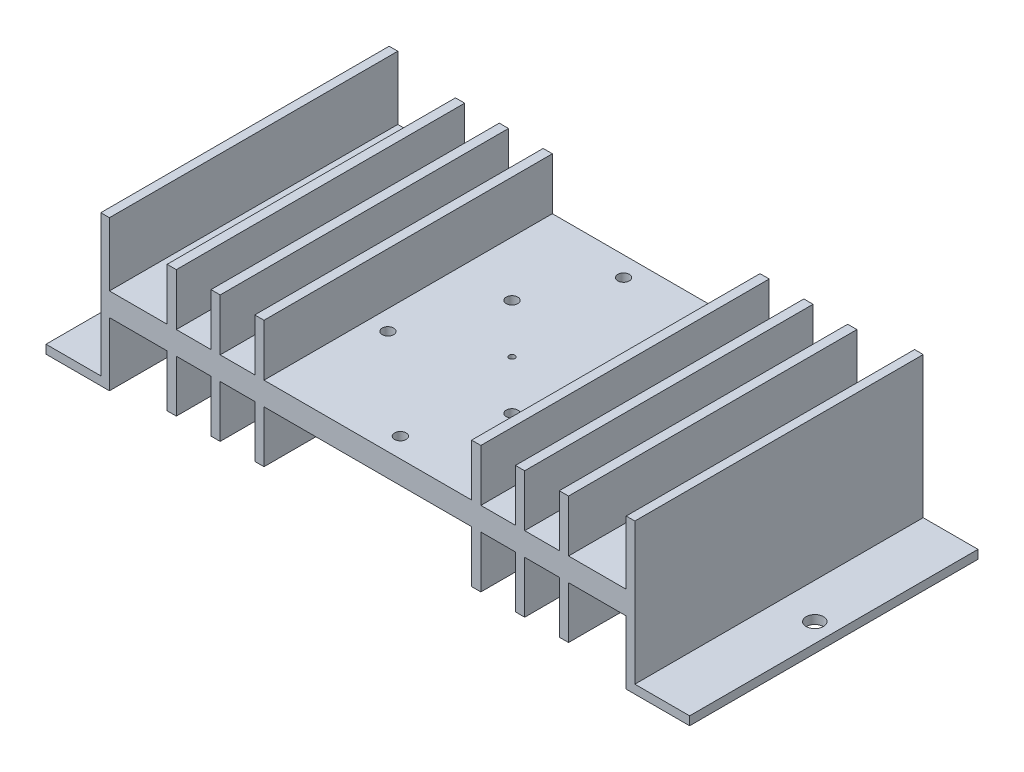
ISO-10303-21;
HEADER;
FILE_DESCRIPTION(('STEP AP214'),'2;1');
FILE_NAME('part.step','',(''),(''),'','','');
FILE_SCHEMA(('AUTOMOTIVE_DESIGN { 1 0 10303 214 1 1 1 1 }'));
ENDSEC;
DATA;
#1=APPLICATION_CONTEXT('core data for automotive mechanical design processes');
#2=APPLICATION_PROTOCOL_DEFINITION('international standard','automotive_design',2000,#1);
#3=PRODUCT_CONTEXT('',#1,'mechanical');
#4=PRODUCT('Part','Part','',(#3));
#5=PRODUCT_RELATED_PRODUCT_CATEGORY('part','',(#4));
#6=PRODUCT_DEFINITION_FORMATION('','',#4);
#7=PRODUCT_DEFINITION_CONTEXT('part definition',#1,'design');
#8=PRODUCT_DEFINITION('design','',#6,#7);
#9=PRODUCT_DEFINITION_SHAPE('','',#8);
#10=(LENGTH_UNIT() NAMED_UNIT(*) SI_UNIT(.MILLI.,.METRE.));
#11=(NAMED_UNIT(*) PLANE_ANGLE_UNIT() SI_UNIT($,.RADIAN.));
#12=(NAMED_UNIT(*) SI_UNIT($,.STERADIAN.) SOLID_ANGLE_UNIT());
#13=UNCERTAINTY_MEASURE_WITH_UNIT(LENGTH_MEASURE(1.E-05),#10,'distance_accuracy_value','');
#14=(GEOMETRIC_REPRESENTATION_CONTEXT(3) GLOBAL_UNCERTAINTY_ASSIGNED_CONTEXT((#13)) GLOBAL_UNIT_ASSIGNED_CONTEXT((#10,
#11,#12)) REPRESENTATION_CONTEXT('',''));
#15=CARTESIAN_POINT('',(0.,0.,0.));
#16=DIRECTION('',(0.,0.,1.));
#17=DIRECTION('',(1.,0.,0.));
#18=AXIS2_PLACEMENT_3D('',#15,#16,#17);
#19=CARTESIAN_POINT('',(-14.5825636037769,0.,50.));
#20=DIRECTION('',(-1.,0.,0.));
#21=DIRECTION('',(0.,0.,1.));
#22=AXIS2_PLACEMENT_3D('',#19,#20,#21);
#23=PLANE('',#22);
#24=DIRECTION('',(0.,1.,0.));
#25=VECTOR('',#24,1.);
#26=CARTESIAN_POINT('',(-14.5825636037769,0.,0.));
#27=LINE('',#26,#25);
#28=CARTESIAN_POINT('',(-14.5825636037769,0.,0.));
#29=VERTEX_POINT('',#28);
#30=CARTESIAN_POINT('',(-14.5825636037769,9.,0.));
#31=VERTEX_POINT('',#30);
#32=EDGE_CURVE('E465',#29,#31,#27,.T.);
#33=ORIENTED_EDGE('',*,*,#32,.T.);
#34=DIRECTION('',(0.,0.,-1.));
#35=VECTOR('',#34,1.);
#36=CARTESIAN_POINT('',(-14.5825636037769,9.,50.));
#37=LINE('',#36,#35);
#38=CARTESIAN_POINT('',(-14.5825636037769,9.,50.));
#39=VERTEX_POINT('',#38);
#40=EDGE_CURVE('E11',#39,#31,#37,.T.);
#41=ORIENTED_EDGE('',*,*,#40,.F.);
#42=DIRECTION('',(0.,1.,0.));
#43=VECTOR('',#42,1.);
#44=CARTESIAN_POINT('',(-14.5825636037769,0.,50.));
#45=LINE('',#44,#43);
#46=CARTESIAN_POINT('',(-14.5825636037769,0.,50.));
#47=VERTEX_POINT('',#46);
#48=EDGE_CURVE('E623',#47,#39,#45,.T.);
#49=ORIENTED_EDGE('',*,*,#48,.F.);
#50=DIRECTION('',(0.,0.,-1.));
#51=VECTOR('',#50,1.);
#52=CARTESIAN_POINT('',(-14.5825636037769,0.,50.));
#53=LINE('',#52,#51);
#54=EDGE_CURVE('E461',#47,#29,#53,.T.);
#55=ORIENTED_EDGE('',*,*,#54,.T.);
#56=EDGE_LOOP('',(#33,#41,#49,#55));
#57=FACE_BOUND('',#56,.T.);
#58=ADVANCED_FACE('F32',(#57),#23,.F.);
#59=CARTESIAN_POINT('',(-14.5825636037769,9.,50.));
#60=DIRECTION('',(0.,1.,0.));
#61=DIRECTION('',(-1.,0.,0.));
#62=AXIS2_PLACEMENT_3D('',#59,#60,#61);
#63=PLANE('',#62);
#64=CARTESIAN_POINT('',(11.9027177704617,8.99999999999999,33.4852813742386));
#65=DIRECTION('',(0.,1.,0.));
#66=DIRECTION('',(1.,0.,0.));
#67=AXIS2_PLACEMENT_3D('',#64,#65,#66);
#68=CIRCLE('',#67,0.999999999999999);
#69=CARTESIAN_POINT('',(12.9027177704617,8.99999999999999,33.4852813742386));
#70=VERTEX_POINT('',#69);
#71=EDGE_CURVE('E1332',#70,#70,#68,.T.);
#72=ORIENTED_EDGE('',*,*,#71,.T.);
#73=EDGE_LOOP('',(#72));
#74=FACE_BOUND('',#73,.T.);
#75=CARTESIAN_POINT('',(-5.06784497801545,8.99999999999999,16.5147186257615));
#76=DIRECTION('',(0.,1.,0.));
#77=DIRECTION('',(-1.,0.,0.));
#78=AXIS2_PLACEMENT_3D('',#75,#76,#77);
#79=CIRCLE('',#78,1.);
#80=CARTESIAN_POINT('',(-6.06784497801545,8.99999999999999,16.5147186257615));
#81=VERTEX_POINT('',#80);
#82=EDGE_CURVE('E1340',#81,#81,#79,.T.);
#83=ORIENTED_EDGE('',*,*,#82,.T.);
#84=EDGE_LOOP('',(#83));
#85=FACE_BOUND('',#84,.T.);
#86=CARTESIAN_POINT('',(3.41743639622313,8.99999999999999,25.));
#87=DIRECTION('',(0.,1.,0.));
#88=DIRECTION('',(-1.,0.,0.));
#89=AXIS2_PLACEMENT_3D('',#86,#87,#88);
#90=CIRCLE('',#89,0.5);
#91=CARTESIAN_POINT('',(2.91743639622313,8.99999999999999,25.));
#92=VERTEX_POINT('',#91);
#93=EDGE_CURVE('E1346',#92,#92,#90,.T.);
#94=ORIENTED_EDGE('',*,*,#93,.T.);
#95=EDGE_LOOP('',(#94));
#96=FACE_BOUND('',#95,.T.);
#97=CARTESIAN_POINT('',(1.18743639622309,8.99999999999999,3.42499999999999));
#98=DIRECTION('',(0.,1.,0.));
#99=DIRECTION('',(-1.,0.,0.));
#100=AXIS2_PLACEMENT_3D('',#97,#98,#99);
#101=CIRCLE('',#100,1.);
#102=CARTESIAN_POINT('',(0.187436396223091,8.99999999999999,3.42499999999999));
#103=VERTEX_POINT('',#102);
#104=EDGE_CURVE('E1352',#103,#103,#101,.T.);
#105=ORIENTED_EDGE('',*,*,#104,.T.);
#106=EDGE_LOOP('',(#105));
#107=FACE_BOUND('',#106,.T.);
#108=CARTESIAN_POINT('',(18.0074363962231,8.99999999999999,18.09));
#109=DIRECTION('',(0.,1.,0.));
#110=DIRECTION('',(-1.,0.,0.));
#111=AXIS2_PLACEMENT_3D('',#108,#109,#110);
#112=CIRCLE('',#111,1.);
#113=CARTESIAN_POINT('',(17.0074363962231,8.99999999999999,18.09));
#114=VERTEX_POINT('',#113);
#115=EDGE_CURVE('E1358',#114,#114,#112,.T.);
#116=ORIENTED_EDGE('',*,*,#115,.T.);
#117=EDGE_LOOP('',(#116));
#118=FACE_BOUND('',#117,.T.);
#119=CARTESIAN_POINT('',(-11.1725636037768,8.99999999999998,31.925));
#120=DIRECTION('',(0.,1.,0.));
#121=DIRECTION('',(-1.,0.,0.));
#122=AXIS2_PLACEMENT_3D('',#119,#120,#121);
#123=CIRCLE('',#122,1.);
#124=CARTESIAN_POINT('',(-12.1725636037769,8.99999999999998,31.925));
#125=VERTEX_POINT('',#124);
#126=EDGE_CURVE('E1364',#125,#125,#123,.T.);
#127=ORIENTED_EDGE('',*,*,#126,.T.);
#128=EDGE_LOOP('',(#127));
#129=FACE_BOUND('',#128,.T.);
#130=CARTESIAN_POINT('',(5.64743639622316,8.99999999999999,46.59));
#131=DIRECTION('',(0.,1.,0.));
#132=DIRECTION('',(-1.,0.,0.));
#133=AXIS2_PLACEMENT_3D('',#130,#131,#132);
#134=CIRCLE('',#133,1.);
#135=CARTESIAN_POINT('',(4.64743639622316,8.99999999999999,46.59));
#136=VERTEX_POINT('',#135);
#137=EDGE_CURVE('E1370',#136,#136,#134,.T.);
#138=ORIENTED_EDGE('',*,*,#137,.T.);
#139=EDGE_LOOP('',(#138));
#140=FACE_BOUND('',#139,.T.);
#141=DIRECTION('',(1.,0.,0.));
#142=VECTOR('',#141,1.);
#143=CARTESIAN_POINT('',(-14.5825636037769,9.,0.));
#144=LINE('',#143,#142);
#145=CARTESIAN_POINT('',(21.4174363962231,9.00000000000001,0.));
#146=VERTEX_POINT('',#145);
#147=EDGE_CURVE('E468',#31,#146,#144,.T.);
#148=ORIENTED_EDGE('',*,*,#147,.T.);
#149=DIRECTION('',(0.,0.,-1.));
#150=VECTOR('',#149,1.);
#151=CARTESIAN_POINT('',(21.4174363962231,9.00000000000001,50.));
#152=LINE('',#151,#150);
#153=CARTESIAN_POINT('',(21.4174363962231,9.00000000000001,50.));
#154=VERTEX_POINT('',#153);
#155=EDGE_CURVE('E41',#154,#146,#152,.T.);
#156=ORIENTED_EDGE('',*,*,#155,.F.);
#157=DIRECTION('',(1.,0.,0.));
#158=VECTOR('',#157,1.);
#159=CARTESIAN_POINT('',(-14.5825636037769,9.,50.));
#160=LINE('',#159,#158);
#161=EDGE_CURVE('E260',#39,#154,#160,.T.);
#162=ORIENTED_EDGE('',*,*,#161,.F.);
#163=ORIENTED_EDGE('',*,*,#40,.T.);
#164=EDGE_LOOP('',(#148,#156,#162,#163));
#165=FACE_BOUND('',#164,.T.);
#166=ADVANCED_FACE('F776',(#74,#85,#96,#107,#118,#129,#140,#165),#63,.F.);
#167=CARTESIAN_POINT('',(21.4174363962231,0.,50.));
#168=DIRECTION('',(-1.,0.,0.));
#169=DIRECTION('',(0.,0.,1.));
#170=AXIS2_PLACEMENT_3D('',#167,#168,#169);
#171=PLANE('',#170);
#172=DIRECTION('',(0.,1.,0.));
#173=VECTOR('',#172,1.);
#174=CARTESIAN_POINT('',(21.4174363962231,0.,0.));
#175=LINE('',#174,#173);
#176=CARTESIAN_POINT('',(21.4174363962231,0.,0.));
#177=VERTEX_POINT('',#176);
#178=EDGE_CURVE('E471',#177,#146,#175,.T.);
#179=ORIENTED_EDGE('',*,*,#178,.F.);
#180=DIRECTION('',(0.,0.,-1.));
#181=VECTOR('',#180,1.);
#182=CARTESIAN_POINT('',(21.4174363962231,0.,50.));
#183=LINE('',#182,#181);
#184=CARTESIAN_POINT('',(21.4174363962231,0.,50.));
#185=VERTEX_POINT('',#184);
#186=EDGE_CURVE('E768',#185,#177,#183,.T.);
#187=ORIENTED_EDGE('',*,*,#186,.F.);
#188=DIRECTION('',(0.,1.,0.));
#189=VECTOR('',#188,1.);
#190=CARTESIAN_POINT('',(21.4174363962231,0.,50.));
#191=LINE('',#190,#189);
#192=EDGE_CURVE('E775',#185,#154,#191,.T.);
#193=ORIENTED_EDGE('',*,*,#192,.T.);
#194=ORIENTED_EDGE('',*,*,#155,.T.);
#195=EDGE_LOOP('',(#179,#187,#193,#194));
#196=FACE_BOUND('',#195,.T.);
#197=ADVANCED_FACE('F773',(#196),#171,.T.);
#198=CARTESIAN_POINT('',(23.0174363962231,0.,50.));
#199=DIRECTION('',(0.,-1.,0.));
#200=DIRECTION('',(1.,0.,0.));
#201=AXIS2_PLACEMENT_3D('',#198,#199,#200);
#202=PLANE('',#201);
#203=DIRECTION('',(-1.,0.,0.));
#204=VECTOR('',#203,1.);
#205=CARTESIAN_POINT('',(23.0174363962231,0.,0.));
#206=LINE('',#205,#204);
#207=CARTESIAN_POINT('',(23.0174363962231,0.,0.));
#208=VERTEX_POINT('',#207);
#209=EDGE_CURVE('E474',#208,#177,#206,.T.);
#210=ORIENTED_EDGE('',*,*,#209,.F.);
#211=DIRECTION('',(0.,0.,-1.));
#212=VECTOR('',#211,1.);
#213=CARTESIAN_POINT('',(23.0174363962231,0.,50.));
#214=LINE('',#213,#212);
#215=CARTESIAN_POINT('',(23.0174363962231,0.,50.));
#216=VERTEX_POINT('',#215);
#217=EDGE_CURVE('E766',#216,#208,#214,.T.);
#218=ORIENTED_EDGE('',*,*,#217,.F.);
#219=DIRECTION('',(-1.,0.,0.));
#220=VECTOR('',#219,1.);
#221=CARTESIAN_POINT('',(23.0174363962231,0.,50.));
#222=LINE('',#221,#220);
#223=EDGE_CURVE('E787',#216,#185,#222,.T.);
#224=ORIENTED_EDGE('',*,*,#223,.T.);
#225=ORIENTED_EDGE('',*,*,#186,.T.);
#226=EDGE_LOOP('',(#210,#218,#224,#225));
#227=FACE_BOUND('',#226,.T.);
#228=ADVANCED_FACE('F784',(#227),#202,.T.);
#229=CARTESIAN_POINT('',(23.0174363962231,8.99999999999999,50.));
#230=DIRECTION('',(1.,0.,0.));
#231=DIRECTION('',(0.,0.,-1.));
#232=AXIS2_PLACEMENT_3D('',#229,#230,#231);
#233=PLANE('',#232);
#234=DIRECTION('',(0.,-1.,0.));
#235=VECTOR('',#234,1.);
#236=CARTESIAN_POINT('',(23.0174363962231,8.99999999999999,0.));
#237=LINE('',#236,#235);
#238=CARTESIAN_POINT('',(23.0174363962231,8.99999999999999,0.));
#239=VERTEX_POINT('',#238);
#240=EDGE_CURVE('E477',#239,#208,#237,.T.);
#241=ORIENTED_EDGE('',*,*,#240,.F.);
#242=DIRECTION('',(0.,0.,-1.));
#243=VECTOR('',#242,1.);
#244=CARTESIAN_POINT('',(23.0174363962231,8.99999999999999,50.));
#245=LINE('',#244,#243);
#246=CARTESIAN_POINT('',(23.0174363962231,8.99999999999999,50.));
#247=VERTEX_POINT('',#246);
#248=EDGE_CURVE('E764',#247,#239,#245,.T.);
#249=ORIENTED_EDGE('',*,*,#248,.F.);
#250=DIRECTION('',(0.,-1.,0.));
#251=VECTOR('',#250,1.);
#252=CARTESIAN_POINT('',(23.0174363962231,8.99999999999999,50.));
#253=LINE('',#252,#251);
#254=EDGE_CURVE('E791',#247,#216,#253,.T.);
#255=ORIENTED_EDGE('',*,*,#254,.T.);
#256=ORIENTED_EDGE('',*,*,#217,.T.);
#257=EDGE_LOOP('',(#241,#249,#255,#256));
#258=FACE_BOUND('',#257,.T.);
#259=ADVANCED_FACE('F972',(#258),#233,.T.);
#260=CARTESIAN_POINT('',(29.0174363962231,8.99999999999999,50.));
#261=DIRECTION('',(0.,-1.,0.));
#262=DIRECTION('',(1.,0.,0.));
#263=AXIS2_PLACEMENT_3D('',#260,#261,#262);
#264=PLANE('',#263);
#265=DIRECTION('',(-1.,0.,0.));
#266=VECTOR('',#265,1.);
#267=CARTESIAN_POINT('',(29.0174363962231,8.99999999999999,0.));
#268=LINE('',#267,#266);
#269=CARTESIAN_POINT('',(29.0174363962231,8.99999999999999,0.));
#270=VERTEX_POINT('',#269);
#271=EDGE_CURVE('E480',#270,#239,#268,.T.);
#272=ORIENTED_EDGE('',*,*,#271,.F.);
#273=DIRECTION('',(0.,0.,-1.));
#274=VECTOR('',#273,1.);
#275=CARTESIAN_POINT('',(29.0174363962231,8.99999999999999,50.));
#276=LINE('',#275,#274);
#277=CARTESIAN_POINT('',(29.0174363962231,8.99999999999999,50.));
#278=VERTEX_POINT('',#277);
#279=EDGE_CURVE('E762',#278,#270,#276,.T.);
#280=ORIENTED_EDGE('',*,*,#279,.F.);
#281=DIRECTION('',(-1.,0.,0.));
#282=VECTOR('',#281,1.);
#283=CARTESIAN_POINT('',(29.0174363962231,8.99999999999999,50.));
#284=LINE('',#283,#282);
#285=EDGE_CURVE('E797',#278,#247,#284,.T.);
#286=ORIENTED_EDGE('',*,*,#285,.T.);
#287=ORIENTED_EDGE('',*,*,#248,.T.);
#288=EDGE_LOOP('',(#272,#280,#286,#287));
#289=FACE_BOUND('',#288,.T.);
#290=ADVANCED_FACE('F975',(#289),#264,.T.);
#291=CARTESIAN_POINT('',(29.0174363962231,0.,50.));
#292=DIRECTION('',(-1.,0.,0.));
#293=DIRECTION('',(0.,0.,1.));
#294=AXIS2_PLACEMENT_3D('',#291,#292,#293);
#295=PLANE('',#294);
#296=DIRECTION('',(0.,1.,0.));
#297=VECTOR('',#296,1.);
#298=CARTESIAN_POINT('',(29.0174363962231,0.,0.));
#299=LINE('',#298,#297);
#300=CARTESIAN_POINT('',(29.0174363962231,0.,0.));
#301=VERTEX_POINT('',#300);
#302=EDGE_CURVE('E483',#301,#270,#299,.T.);
#303=ORIENTED_EDGE('',*,*,#302,.F.);
#304=DIRECTION('',(0.,0.,-1.));
#305=VECTOR('',#304,1.);
#306=CARTESIAN_POINT('',(29.0174363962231,0.,50.));
#307=LINE('',#306,#305);
#308=CARTESIAN_POINT('',(29.0174363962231,0.,50.));
#309=VERTEX_POINT('',#308);
#310=EDGE_CURVE('E760',#309,#301,#307,.T.);
#311=ORIENTED_EDGE('',*,*,#310,.F.);
#312=DIRECTION('',(0.,1.,0.));
#313=VECTOR('',#312,1.);
#314=CARTESIAN_POINT('',(29.0174363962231,0.,50.));
#315=LINE('',#314,#313);
#316=EDGE_CURVE('E800',#309,#278,#315,.T.);
#317=ORIENTED_EDGE('',*,*,#316,.T.);
#318=ORIENTED_EDGE('',*,*,#279,.T.);
#319=EDGE_LOOP('',(#303,#311,#317,#318));
#320=FACE_BOUND('',#319,.T.);
#321=ADVANCED_FACE('F979',(#320),#295,.T.);
#322=CARTESIAN_POINT('',(30.6174363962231,0.,50.));
#323=DIRECTION('',(0.,-1.,0.));
#324=DIRECTION('',(1.,0.,0.));
#325=AXIS2_PLACEMENT_3D('',#322,#323,#324);
#326=PLANE('',#325);
#327=DIRECTION('',(-1.,0.,0.));
#328=VECTOR('',#327,1.);
#329=CARTESIAN_POINT('',(30.6174363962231,0.,0.));
#330=LINE('',#329,#328);
#331=CARTESIAN_POINT('',(30.6174363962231,0.,0.));
#332=VERTEX_POINT('',#331);
#333=EDGE_CURVE('E486',#332,#301,#330,.T.);
#334=ORIENTED_EDGE('',*,*,#333,.F.);
#335=DIRECTION('',(0.,0.,-1.));
#336=VECTOR('',#335,1.);
#337=CARTESIAN_POINT('',(30.6174363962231,0.,50.));
#338=LINE('',#337,#336);
#339=CARTESIAN_POINT('',(30.6174363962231,0.,50.));
#340=VERTEX_POINT('',#339);
#341=EDGE_CURVE('E758',#340,#332,#338,.T.);
#342=ORIENTED_EDGE('',*,*,#341,.F.);
#343=DIRECTION('',(-1.,0.,0.));
#344=VECTOR('',#343,1.);
#345=CARTESIAN_POINT('',(30.6174363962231,0.,50.));
#346=LINE('',#345,#344);
#347=EDGE_CURVE('E803',#340,#309,#346,.T.);
#348=ORIENTED_EDGE('',*,*,#347,.T.);
#349=ORIENTED_EDGE('',*,*,#310,.T.);
#350=EDGE_LOOP('',(#334,#342,#348,#349));
#351=FACE_BOUND('',#350,.T.);
#352=ADVANCED_FACE('F983',(#351),#326,.T.);
#353=CARTESIAN_POINT('',(30.6174363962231,8.99999999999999,50.));
#354=DIRECTION('',(1.,0.,0.));
#355=DIRECTION('',(0.,1.,0.));
#356=AXIS2_PLACEMENT_3D('',#353,#354,#355);
#357=PLANE('',#356);
#358=DIRECTION('',(0.,-1.,0.));
#359=VECTOR('',#358,1.);
#360=CARTESIAN_POINT('',(30.6174363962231,8.99999999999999,0.));
#361=LINE('',#360,#359);
#362=CARTESIAN_POINT('',(30.6174363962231,8.99999999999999,0.));
#363=VERTEX_POINT('',#362);
#364=EDGE_CURVE('E489',#363,#332,#361,.T.);
#365=ORIENTED_EDGE('',*,*,#364,.F.);
#366=DIRECTION('',(0.,0.,-1.));
#367=VECTOR('',#366,1.);
#368=CARTESIAN_POINT('',(30.6174363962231,8.99999999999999,50.));
#369=LINE('',#368,#367);
#370=CARTESIAN_POINT('',(30.6174363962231,8.99999999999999,50.));
#371=VERTEX_POINT('',#370);
#372=EDGE_CURVE('E756',#371,#363,#369,.T.);
#373=ORIENTED_EDGE('',*,*,#372,.F.);
#374=DIRECTION('',(0.,-1.,0.));
#375=VECTOR('',#374,1.);
#376=CARTESIAN_POINT('',(30.6174363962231,8.99999999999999,50.));
#377=LINE('',#376,#375);
#378=EDGE_CURVE('E806',#371,#340,#377,.T.);
#379=ORIENTED_EDGE('',*,*,#378,.T.);
#380=ORIENTED_EDGE('',*,*,#341,.T.);
#381=EDGE_LOOP('',(#365,#373,#379,#380));
#382=FACE_BOUND('',#381,.T.);
#383=ADVANCED_FACE('F987',(#382),#357,.T.);
#384=CARTESIAN_POINT('',(36.6174363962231,8.99999999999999,50.));
#385=DIRECTION('',(0.,-1.,0.));
#386=DIRECTION('',(1.,0.,0.));
#387=AXIS2_PLACEMENT_3D('',#384,#385,#386);
#388=PLANE('',#387);
#389=DIRECTION('',(-1.,0.,0.));
#390=VECTOR('',#389,1.);
#391=CARTESIAN_POINT('',(36.6174363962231,8.99999999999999,0.));
#392=LINE('',#391,#390);
#393=CARTESIAN_POINT('',(36.6174363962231,8.99999999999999,0.));
#394=VERTEX_POINT('',#393);
#395=EDGE_CURVE('E492',#394,#363,#392,.T.);
#396=ORIENTED_EDGE('',*,*,#395,.F.);
#397=DIRECTION('',(0.,0.,-1.));
#398=VECTOR('',#397,1.);
#399=CARTESIAN_POINT('',(36.6174363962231,8.99999999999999,50.));
#400=LINE('',#399,#398);
#401=CARTESIAN_POINT('',(36.6174363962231,8.99999999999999,50.));
#402=VERTEX_POINT('',#401);
#403=EDGE_CURVE('E754',#402,#394,#400,.T.);
#404=ORIENTED_EDGE('',*,*,#403,.F.);
#405=DIRECTION('',(-1.,0.,0.));
#406=VECTOR('',#405,1.);
#407=CARTESIAN_POINT('',(36.6174363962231,8.99999999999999,50.));
#408=LINE('',#407,#406);
#409=EDGE_CURVE('E809',#402,#371,#408,.T.);
#410=ORIENTED_EDGE('',*,*,#409,.T.);
#411=ORIENTED_EDGE('',*,*,#372,.T.);
#412=EDGE_LOOP('',(#396,#404,#410,#411));
#413=FACE_BOUND('',#412,.T.);
#414=ADVANCED_FACE('F991',(#413),#388,.T.);
#415=CARTESIAN_POINT('',(36.6174363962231,0.,50.));
#416=DIRECTION('',(-1.,0.,0.));
#417=DIRECTION('',(0.,0.,1.));
#418=AXIS2_PLACEMENT_3D('',#415,#416,#417);
#419=PLANE('',#418);
#420=DIRECTION('',(0.,1.,0.));
#421=VECTOR('',#420,1.);
#422=CARTESIAN_POINT('',(36.6174363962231,0.,0.));
#423=LINE('',#422,#421);
#424=CARTESIAN_POINT('',(36.6174363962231,0.,0.));
#425=VERTEX_POINT('',#424);
#426=EDGE_CURVE('E495',#425,#394,#423,.T.);
#427=ORIENTED_EDGE('',*,*,#426,.F.);
#428=DIRECTION('',(0.,0.,-1.));
#429=VECTOR('',#428,1.);
#430=CARTESIAN_POINT('',(36.6174363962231,0.,50.));
#431=LINE('',#430,#429);
#432=CARTESIAN_POINT('',(36.6174363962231,0.,50.));
#433=VERTEX_POINT('',#432);
#434=EDGE_CURVE('E752',#433,#425,#431,.T.);
#435=ORIENTED_EDGE('',*,*,#434,.F.);
#436=DIRECTION('',(0.,1.,0.));
#437=VECTOR('',#436,1.);
#438=CARTESIAN_POINT('',(36.6174363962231,0.,50.));
#439=LINE('',#438,#437);
#440=EDGE_CURVE('E812',#433,#402,#439,.T.);
#441=ORIENTED_EDGE('',*,*,#440,.T.);
#442=ORIENTED_EDGE('',*,*,#403,.T.);
#443=EDGE_LOOP('',(#427,#435,#441,#442));
#444=FACE_BOUND('',#443,.T.);
#445=ADVANCED_FACE('F995',(#444),#419,.T.);
#446=CARTESIAN_POINT('',(38.2174363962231,0.,50.));
#447=DIRECTION('',(0.,-1.,0.));
#448=DIRECTION('',(1.,0.,0.));
#449=AXIS2_PLACEMENT_3D('',#446,#447,#448);
#450=PLANE('',#449);
#451=DIRECTION('',(-1.,0.,0.));
#452=VECTOR('',#451,1.);
#453=CARTESIAN_POINT('',(38.2174363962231,0.,0.));
#454=LINE('',#453,#452);
#455=CARTESIAN_POINT('',(38.2174363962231,0.,0.));
#456=VERTEX_POINT('',#455);
#457=EDGE_CURVE('E498',#456,#425,#454,.T.);
#458=ORIENTED_EDGE('',*,*,#457,.F.);
#459=DIRECTION('',(0.,0.,-1.));
#460=VECTOR('',#459,1.);
#461=CARTESIAN_POINT('',(38.2174363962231,0.,50.));
#462=LINE('',#461,#460);
#463=CARTESIAN_POINT('',(38.2174363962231,0.,50.));
#464=VERTEX_POINT('',#463);
#465=EDGE_CURVE('E750',#464,#456,#462,.T.);
#466=ORIENTED_EDGE('',*,*,#465,.F.);
#467=DIRECTION('',(-1.,0.,0.));
#468=VECTOR('',#467,1.);
#469=CARTESIAN_POINT('',(38.2174363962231,0.,50.));
#470=LINE('',#469,#468);
#471=EDGE_CURVE('E815',#464,#433,#470,.T.);
#472=ORIENTED_EDGE('',*,*,#471,.T.);
#473=ORIENTED_EDGE('',*,*,#434,.T.);
#474=EDGE_LOOP('',(#458,#466,#472,#473));
#475=FACE_BOUND('',#474,.T.);
#476=ADVANCED_FACE('F999',(#475),#450,.T.);
#477=CARTESIAN_POINT('',(38.2174363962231,8.99999999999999,50.));
#478=DIRECTION('',(1.,0.,0.));
#479=DIRECTION('',(0.,0.,-1.));
#480=AXIS2_PLACEMENT_3D('',#477,#478,#479);
#481=PLANE('',#480);
#482=DIRECTION('',(0.,-1.,0.));
#483=VECTOR('',#482,1.);
#484=CARTESIAN_POINT('',(38.2174363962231,8.99999999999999,0.));
#485=LINE('',#484,#483);
#486=CARTESIAN_POINT('',(38.2174363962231,8.99999999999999,0.));
#487=VERTEX_POINT('',#486);
#488=EDGE_CURVE('E501',#487,#456,#485,.T.);
#489=ORIENTED_EDGE('',*,*,#488,.F.);
#490=DIRECTION('',(0.,0.,-1.));
#491=VECTOR('',#490,1.);
#492=CARTESIAN_POINT('',(38.2174363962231,8.99999999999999,50.));
#493=LINE('',#492,#491);
#494=CARTESIAN_POINT('',(38.2174363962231,8.99999999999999,50.));
#495=VERTEX_POINT('',#494);
#496=EDGE_CURVE('E748',#495,#487,#493,.T.);
#497=ORIENTED_EDGE('',*,*,#496,.F.);
#498=DIRECTION('',(0.,-1.,0.));
#499=VECTOR('',#498,1.);
#500=CARTESIAN_POINT('',(38.2174363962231,8.99999999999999,50.));
#501=LINE('',#500,#499);
#502=EDGE_CURVE('E818',#495,#464,#501,.T.);
#503=ORIENTED_EDGE('',*,*,#502,.T.);
#504=ORIENTED_EDGE('',*,*,#465,.T.);
#505=EDGE_LOOP('',(#489,#497,#503,#504));
#506=FACE_BOUND('',#505,.T.);
#507=ADVANCED_FACE('F1003',(#506),#481,.T.);
#508=CARTESIAN_POINT('',(48.2174363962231,9.,50.));
#509=DIRECTION('',(0.,-1.,0.));
#510=DIRECTION('',(1.,0.,0.));
#511=AXIS2_PLACEMENT_3D('',#508,#509,#510);
#512=PLANE('',#511);
#513=DIRECTION('',(-1.,0.,0.));
#514=VECTOR('',#513,1.);
#515=CARTESIAN_POINT('',(48.2174363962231,9.,0.));
#516=LINE('',#515,#514);
#517=CARTESIAN_POINT('',(48.2174363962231,9.,0.));
#518=VERTEX_POINT('',#517);
#519=EDGE_CURVE('E504',#518,#487,#516,.T.);
#520=ORIENTED_EDGE('',*,*,#519,.F.);
#521=DIRECTION('',(0.,0.,-1.));
#522=VECTOR('',#521,1.);
#523=CARTESIAN_POINT('',(48.2174363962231,9.,50.));
#524=LINE('',#523,#522);
#525=CARTESIAN_POINT('',(48.2174363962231,9.,50.));
#526=VERTEX_POINT('',#525);
#527=EDGE_CURVE('E746',#526,#518,#524,.T.);
#528=ORIENTED_EDGE('',*,*,#527,.F.);
#529=DIRECTION('',(-1.,0.,0.));
#530=VECTOR('',#529,1.);
#531=CARTESIAN_POINT('',(48.2174363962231,9.,50.));
#532=LINE('',#531,#530);
#533=EDGE_CURVE('E821',#526,#495,#532,.T.);
#534=ORIENTED_EDGE('',*,*,#533,.T.);
#535=ORIENTED_EDGE('',*,*,#496,.T.);
#536=EDGE_LOOP('',(#520,#528,#534,#535));
#537=FACE_BOUND('',#536,.T.);
#538=ADVANCED_FACE('F1007',(#537),#512,.T.);
#539=CARTESIAN_POINT('',(48.2174363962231,-1.99999999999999,50.));
#540=DIRECTION('',(-1.,0.,0.));
#541=DIRECTION('',(0.,0.,1.));
#542=AXIS2_PLACEMENT_3D('',#539,#540,#541);
#543=PLANE('',#542);
#544=DIRECTION('',(0.,1.,0.));
#545=VECTOR('',#544,1.);
#546=CARTESIAN_POINT('',(48.2174363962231,-1.99999999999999,0.));
#547=LINE('',#546,#545);
#548=CARTESIAN_POINT('',(48.2174363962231,-1.99999999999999,0.));
#549=VERTEX_POINT('',#548);
#550=EDGE_CURVE('E507',#549,#518,#547,.T.);
#551=ORIENTED_EDGE('',*,*,#550,.F.);
#552=DIRECTION('',(0.,0.,-1.));
#553=VECTOR('',#552,1.);
#554=CARTESIAN_POINT('',(48.2174363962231,-1.99999999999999,50.));
#555=LINE('',#554,#553);
#556=CARTESIAN_POINT('',(48.2174363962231,-1.99999999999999,50.));
#557=VERTEX_POINT('',#556);
#558=EDGE_CURVE('E744',#557,#549,#555,.T.);
#559=ORIENTED_EDGE('',*,*,#558,.F.);
#560=DIRECTION('',(0.,1.,0.));
#561=VECTOR('',#560,1.);
#562=CARTESIAN_POINT('',(48.2174363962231,-1.99999999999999,50.));
#563=LINE('',#562,#561);
#564=EDGE_CURVE('E824',#557,#526,#563,.T.);
#565=ORIENTED_EDGE('',*,*,#564,.T.);
#566=ORIENTED_EDGE('',*,*,#527,.T.);
#567=EDGE_LOOP('',(#551,#559,#565,#566));
#568=FACE_BOUND('',#567,.T.);
#569=ADVANCED_FACE('F1011',(#568),#543,.T.);
#570=CARTESIAN_POINT('',(59.2174363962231,-1.99999999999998,50.));
#571=DIRECTION('',(0.,-1.,0.));
#572=DIRECTION('',(1.,0.,0.));
#573=AXIS2_PLACEMENT_3D('',#570,#571,#572);
#574=PLANE('',#573);
#575=CARTESIAN_POINT('',(55.9174363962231,-1.99999999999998,25.));
#576=DIRECTION('',(0.,-1.,0.));
#577=DIRECTION('',(1.,0.,0.));
#578=AXIS2_PLACEMENT_3D('',#575,#576,#577);
#579=CIRCLE('',#578,1.5);
#580=CARTESIAN_POINT('',(57.4174363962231,-1.99999999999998,25.));
#581=VERTEX_POINT('',#580);
#582=EDGE_CURVE('E1378',#581,#581,#579,.T.);
#583=ORIENTED_EDGE('',*,*,#582,.F.);
#584=EDGE_LOOP('',(#583));
#585=FACE_BOUND('',#584,.T.);
#586=DIRECTION('',(-1.,0.,0.));
#587=VECTOR('',#586,1.);
#588=CARTESIAN_POINT('',(59.2174363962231,-1.99999999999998,0.));
#589=LINE('',#588,#587);
#590=CARTESIAN_POINT('',(59.2174363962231,-1.99999999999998,0.));
#591=VERTEX_POINT('',#590);
#592=EDGE_CURVE('E510',#591,#549,#589,.T.);
#593=ORIENTED_EDGE('',*,*,#592,.F.);
#594=DIRECTION('',(0.,0.,-1.));
#595=VECTOR('',#594,1.);
#596=CARTESIAN_POINT('',(59.2174363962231,-1.99999999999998,50.));
#597=LINE('',#596,#595);
#598=CARTESIAN_POINT('',(59.2174363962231,-1.99999999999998,50.));
#599=VERTEX_POINT('',#598);
#600=EDGE_CURVE('E742',#599,#591,#597,.T.);
#601=ORIENTED_EDGE('',*,*,#600,.F.);
#602=DIRECTION('',(-1.,0.,0.));
#603=VECTOR('',#602,1.);
#604=CARTESIAN_POINT('',(59.2174363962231,-1.99999999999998,50.));
#605=LINE('',#604,#603);
#606=EDGE_CURVE('E827',#599,#557,#605,.T.);
#607=ORIENTED_EDGE('',*,*,#606,.T.);
#608=ORIENTED_EDGE('',*,*,#558,.T.);
#609=EDGE_LOOP('',(#593,#601,#607,#608));
#610=FACE_BOUND('',#609,.T.);
#611=ADVANCED_FACE('F1015',(#585,#610),#574,.T.);
#612=CARTESIAN_POINT('',(59.2174363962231,-0.499999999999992,50.));
#613=DIRECTION('',(1.,0.,0.));
#614=DIRECTION('',(0.,0.,-1.));
#615=AXIS2_PLACEMENT_3D('',#612,#613,#614);
#616=PLANE('',#615);
#617=DIRECTION('',(0.,-1.,0.));
#618=VECTOR('',#617,1.);
#619=CARTESIAN_POINT('',(59.2174363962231,-0.499999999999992,0.));
#620=LINE('',#619,#618);
#621=CARTESIAN_POINT('',(59.2174363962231,-0.499999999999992,0.));
#622=VERTEX_POINT('',#621);
#623=EDGE_CURVE('E513',#622,#591,#620,.T.);
#624=ORIENTED_EDGE('',*,*,#623,.F.);
#625=DIRECTION('',(0.,0.,-1.));
#626=VECTOR('',#625,1.);
#627=CARTESIAN_POINT('',(59.2174363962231,-0.499999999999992,50.));
#628=LINE('',#627,#626);
#629=CARTESIAN_POINT('',(59.2174363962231,-0.499999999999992,50.));
#630=VERTEX_POINT('',#629);
#631=EDGE_CURVE('E740',#630,#622,#628,.T.);
#632=ORIENTED_EDGE('',*,*,#631,.F.);
#633=DIRECTION('',(0.,-1.,0.));
#634=VECTOR('',#633,1.);
#635=CARTESIAN_POINT('',(59.2174363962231,-0.499999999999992,50.));
#636=LINE('',#635,#634);
#637=EDGE_CURVE('E830',#630,#599,#636,.T.);
#638=ORIENTED_EDGE('',*,*,#637,.T.);
#639=ORIENTED_EDGE('',*,*,#600,.T.);
#640=EDGE_LOOP('',(#624,#632,#638,#639));
#641=FACE_BOUND('',#640,.T.);
#642=ADVANCED_FACE('F1019',(#641),#616,.T.);
#643=CARTESIAN_POINT('',(49.7174363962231,-0.5,50.));
#644=DIRECTION('',(0.,1.,0.));
#645=DIRECTION('',(-1.,0.,0.));
#646=AXIS2_PLACEMENT_3D('',#643,#644,#645);
#647=PLANE('',#646);
#648=CARTESIAN_POINT('',(55.9174363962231,-0.499999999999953,25.));
#649=DIRECTION('',(0.,1.,0.));
#650=DIRECTION('',(-1.,0.,0.));
#651=AXIS2_PLACEMENT_3D('',#648,#649,#650);
#652=CIRCLE('',#651,1.5);
#653=CARTESIAN_POINT('',(54.4174363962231,-0.499999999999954,25.));
#654=VERTEX_POINT('',#653);
#655=EDGE_CURVE('E1373',#654,#654,#652,.T.);
#656=ORIENTED_EDGE('',*,*,#655,.F.);
#657=EDGE_LOOP('',(#656));
#658=FACE_BOUND('',#657,.T.);
#659=DIRECTION('',(1.,0.,0.));
#660=VECTOR('',#659,1.);
#661=CARTESIAN_POINT('',(49.7174363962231,-0.5,0.));
#662=LINE('',#661,#660);
#663=CARTESIAN_POINT('',(49.7174363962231,-0.5,0.));
#664=VERTEX_POINT('',#663);
#665=EDGE_CURVE('E516',#664,#622,#662,.T.);
#666=ORIENTED_EDGE('',*,*,#665,.F.);
#667=DIRECTION('',(0.,0.,-1.));
#668=VECTOR('',#667,1.);
#669=CARTESIAN_POINT('',(49.7174363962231,-0.5,50.));
#670=LINE('',#669,#668);
#671=CARTESIAN_POINT('',(49.7174363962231,-0.5,50.));
#672=VERTEX_POINT('',#671);
#673=EDGE_CURVE('E738',#672,#664,#670,.T.);
#674=ORIENTED_EDGE('',*,*,#673,.F.);
#675=DIRECTION('',(1.,0.,0.));
#676=VECTOR('',#675,1.);
#677=CARTESIAN_POINT('',(49.7174363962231,-0.5,50.));
#678=LINE('',#677,#676);
#679=EDGE_CURVE('E833',#672,#630,#678,.T.);
#680=ORIENTED_EDGE('',*,*,#679,.T.);
#681=ORIENTED_EDGE('',*,*,#631,.T.);
#682=EDGE_LOOP('',(#666,#674,#680,#681));
#683=FACE_BOUND('',#682,.T.);
#684=ADVANCED_FACE('F1023',(#658,#683),#647,.T.);
#685=CARTESIAN_POINT('',(49.7174363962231,24.,50.));
#686=DIRECTION('',(1.,0.,0.));
#687=DIRECTION('',(0.,1.,0.));
#688=AXIS2_PLACEMENT_3D('',#685,#686,#687);
#689=PLANE('',#688);
#690=DIRECTION('',(0.,-1.,0.));
#691=VECTOR('',#690,1.);
#692=CARTESIAN_POINT('',(49.7174363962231,24.,0.));
#693=LINE('',#692,#691);
#694=CARTESIAN_POINT('',(49.7174363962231,24.,0.));
#695=VERTEX_POINT('',#694);
#696=EDGE_CURVE('E519',#695,#664,#693,.T.);
#697=ORIENTED_EDGE('',*,*,#696,.F.);
#698=DIRECTION('',(0.,0.,-1.));
#699=VECTOR('',#698,1.);
#700=CARTESIAN_POINT('',(49.7174363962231,24.,50.));
#701=LINE('',#700,#699);
#702=CARTESIAN_POINT('',(49.7174363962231,24.,50.));
#703=VERTEX_POINT('',#702);
#704=EDGE_CURVE('E736',#703,#695,#701,.T.);
#705=ORIENTED_EDGE('',*,*,#704,.F.);
#706=DIRECTION('',(0.,-1.,0.));
#707=VECTOR('',#706,1.);
#708=CARTESIAN_POINT('',(49.7174363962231,24.,50.));
#709=LINE('',#708,#707);
#710=EDGE_CURVE('E836',#703,#672,#709,.T.);
#711=ORIENTED_EDGE('',*,*,#710,.T.);
#712=ORIENTED_EDGE('',*,*,#673,.T.);
#713=EDGE_LOOP('',(#697,#705,#711,#712));
#714=FACE_BOUND('',#713,.T.);
#715=ADVANCED_FACE('F1027',(#714),#689,.T.);
#716=CARTESIAN_POINT('',(48.2174363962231,24.,50.));
#717=DIRECTION('',(0.,1.,0.));
#718=DIRECTION('',(0.,0.,1.));
#719=AXIS2_PLACEMENT_3D('',#716,#717,#718);
#720=PLANE('',#719);
#721=DIRECTION('',(1.,0.,0.));
#722=VECTOR('',#721,1.);
#723=CARTESIAN_POINT('',(48.2174363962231,24.,0.));
#724=LINE('',#723,#722);
#725=CARTESIAN_POINT('',(48.2174363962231,24.,0.));
#726=VERTEX_POINT('',#725);
#727=EDGE_CURVE('E522',#726,#695,#724,.T.);
#728=ORIENTED_EDGE('',*,*,#727,.F.);
#729=DIRECTION('',(0.,0.,-1.));
#730=VECTOR('',#729,1.);
#731=CARTESIAN_POINT('',(48.2174363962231,24.,50.));
#732=LINE('',#731,#730);
#733=CARTESIAN_POINT('',(48.2174363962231,24.,50.));
#734=VERTEX_POINT('',#733);
#735=EDGE_CURVE('E734',#734,#726,#732,.T.);
#736=ORIENTED_EDGE('',*,*,#735,.F.);
#737=DIRECTION('',(1.,0.,0.));
#738=VECTOR('',#737,1.);
#739=CARTESIAN_POINT('',(48.2174363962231,24.,50.));
#740=LINE('',#739,#738);
#741=EDGE_CURVE('E839',#734,#703,#740,.T.);
#742=ORIENTED_EDGE('',*,*,#741,.T.);
#743=ORIENTED_EDGE('',*,*,#704,.T.);
#744=EDGE_LOOP('',(#728,#736,#742,#743));
#745=FACE_BOUND('',#744,.T.);
#746=ADVANCED_FACE('F1031',(#745),#720,.T.);
#747=CARTESIAN_POINT('',(48.2174363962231,13.,50.));
#748=DIRECTION('',(-1.,0.,0.));
#749=DIRECTION('',(0.,0.,1.));
#750=AXIS2_PLACEMENT_3D('',#747,#748,#749);
#751=PLANE('',#750);
#752=DIRECTION('',(0.,1.,0.));
#753=VECTOR('',#752,1.);
#754=CARTESIAN_POINT('',(48.2174363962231,13.,0.));
#755=LINE('',#754,#753);
#756=CARTESIAN_POINT('',(48.2174363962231,13.,0.));
#757=VERTEX_POINT('',#756);
#758=EDGE_CURVE('E525',#757,#726,#755,.T.);
#759=ORIENTED_EDGE('',*,*,#758,.F.);
#760=DIRECTION('',(0.,0.,-1.));
#761=VECTOR('',#760,1.);
#762=CARTESIAN_POINT('',(48.2174363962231,13.,50.));
#763=LINE('',#762,#761);
#764=CARTESIAN_POINT('',(48.2174363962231,13.,50.));
#765=VERTEX_POINT('',#764);
#766=EDGE_CURVE('E732',#765,#757,#763,.T.);
#767=ORIENTED_EDGE('',*,*,#766,.F.);
#768=DIRECTION('',(0.,1.,0.));
#769=VECTOR('',#768,1.);
#770=CARTESIAN_POINT('',(48.2174363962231,13.,50.));
#771=LINE('',#770,#769);
#772=EDGE_CURVE('E842',#765,#734,#771,.T.);
#773=ORIENTED_EDGE('',*,*,#772,.T.);
#774=ORIENTED_EDGE('',*,*,#735,.T.);
#775=EDGE_LOOP('',(#759,#767,#773,#774));
#776=FACE_BOUND('',#775,.T.);
#777=ADVANCED_FACE('F1035',(#776),#751,.T.);
#778=CARTESIAN_POINT('',(38.2174363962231,13.,50.));
#779=DIRECTION('',(0.,1.,0.));
#780=DIRECTION('',(-1.,0.,0.));
#781=AXIS2_PLACEMENT_3D('',#778,#779,#780);
#782=PLANE('',#781);
#783=DIRECTION('',(1.,0.,0.));
#784=VECTOR('',#783,1.);
#785=CARTESIAN_POINT('',(38.2174363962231,13.,0.));
#786=LINE('',#785,#784);
#787=CARTESIAN_POINT('',(38.2174363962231,13.,0.));
#788=VERTEX_POINT('',#787);
#789=EDGE_CURVE('E528',#788,#757,#786,.T.);
#790=ORIENTED_EDGE('',*,*,#789,.F.);
#791=DIRECTION('',(0.,0.,-1.));
#792=VECTOR('',#791,1.);
#793=CARTESIAN_POINT('',(38.2174363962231,13.,50.));
#794=LINE('',#793,#792);
#795=CARTESIAN_POINT('',(38.2174363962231,13.,50.));
#796=VERTEX_POINT('',#795);
#797=EDGE_CURVE('E730',#796,#788,#794,.T.);
#798=ORIENTED_EDGE('',*,*,#797,.F.);
#799=DIRECTION('',(1.,0.,0.));
#800=VECTOR('',#799,1.);
#801=CARTESIAN_POINT('',(38.2174363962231,13.,50.));
#802=LINE('',#801,#800);
#803=EDGE_CURVE('E845',#796,#765,#802,.T.);
#804=ORIENTED_EDGE('',*,*,#803,.T.);
#805=ORIENTED_EDGE('',*,*,#766,.T.);
#806=EDGE_LOOP('',(#790,#798,#804,#805));
#807=FACE_BOUND('',#806,.T.);
#808=ADVANCED_FACE('F1039',(#807),#782,.T.);
#809=CARTESIAN_POINT('',(38.2174363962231,22.,50.));
#810=DIRECTION('',(1.,0.,0.));
#811=DIRECTION('',(0.,0.,-1.));
#812=AXIS2_PLACEMENT_3D('',#809,#810,#811);
#813=PLANE('',#812);
#814=DIRECTION('',(0.,-1.,0.));
#815=VECTOR('',#814,1.);
#816=CARTESIAN_POINT('',(38.2174363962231,22.,0.));
#817=LINE('',#816,#815);
#818=CARTESIAN_POINT('',(38.2174363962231,22.,0.));
#819=VERTEX_POINT('',#818);
#820=EDGE_CURVE('E531',#819,#788,#817,.T.);
#821=ORIENTED_EDGE('',*,*,#820,.F.);
#822=DIRECTION('',(0.,0.,-1.));
#823=VECTOR('',#822,1.);
#824=CARTESIAN_POINT('',(38.2174363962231,22.,50.));
#825=LINE('',#824,#823);
#826=CARTESIAN_POINT('',(38.2174363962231,22.,50.));
#827=VERTEX_POINT('',#826);
#828=EDGE_CURVE('E728',#827,#819,#825,.T.);
#829=ORIENTED_EDGE('',*,*,#828,.F.);
#830=DIRECTION('',(0.,-1.,0.));
#831=VECTOR('',#830,1.);
#832=CARTESIAN_POINT('',(38.2174363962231,22.,50.));
#833=LINE('',#832,#831);
#834=EDGE_CURVE('E848',#827,#796,#833,.T.);
#835=ORIENTED_EDGE('',*,*,#834,.T.);
#836=ORIENTED_EDGE('',*,*,#797,.T.);
#837=EDGE_LOOP('',(#821,#829,#835,#836));
#838=FACE_BOUND('',#837,.T.);
#839=ADVANCED_FACE('F1043',(#838),#813,.T.);
#840=CARTESIAN_POINT('',(36.6174363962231,22.,50.));
#841=DIRECTION('',(0.,1.,0.));
#842=DIRECTION('',(0.,0.,1.));
#843=AXIS2_PLACEMENT_3D('',#840,#841,#842);
#844=PLANE('',#843);
#845=DIRECTION('',(1.,0.,0.));
#846=VECTOR('',#845,1.);
#847=CARTESIAN_POINT('',(36.6174363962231,22.,0.));
#848=LINE('',#847,#846);
#849=CARTESIAN_POINT('',(36.6174363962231,22.,0.));
#850=VERTEX_POINT('',#849);
#851=EDGE_CURVE('E534',#850,#819,#848,.T.);
#852=ORIENTED_EDGE('',*,*,#851,.F.);
#853=DIRECTION('',(0.,0.,-1.));
#854=VECTOR('',#853,1.);
#855=CARTESIAN_POINT('',(36.6174363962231,22.,50.));
#856=LINE('',#855,#854);
#857=CARTESIAN_POINT('',(36.6174363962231,22.,50.));
#858=VERTEX_POINT('',#857);
#859=EDGE_CURVE('E726',#858,#850,#856,.T.);
#860=ORIENTED_EDGE('',*,*,#859,.F.);
#861=DIRECTION('',(1.,0.,0.));
#862=VECTOR('',#861,1.);
#863=CARTESIAN_POINT('',(36.6174363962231,22.,50.));
#864=LINE('',#863,#862);
#865=EDGE_CURVE('E851',#858,#827,#864,.T.);
#866=ORIENTED_EDGE('',*,*,#865,.T.);
#867=ORIENTED_EDGE('',*,*,#828,.T.);
#868=EDGE_LOOP('',(#852,#860,#866,#867));
#869=FACE_BOUND('',#868,.T.);
#870=ADVANCED_FACE('F1047',(#869),#844,.T.);
#871=CARTESIAN_POINT('',(36.6174363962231,13.,50.));
#872=DIRECTION('',(-1.,0.,0.));
#873=DIRECTION('',(0.,-1.,0.));
#874=AXIS2_PLACEMENT_3D('',#871,#872,#873);
#875=PLANE('',#874);
#876=DIRECTION('',(0.,1.,0.));
#877=VECTOR('',#876,1.);
#878=CARTESIAN_POINT('',(36.6174363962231,13.,0.));
#879=LINE('',#878,#877);
#880=CARTESIAN_POINT('',(36.6174363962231,13.,0.));
#881=VERTEX_POINT('',#880);
#882=EDGE_CURVE('E537',#881,#850,#879,.T.);
#883=ORIENTED_EDGE('',*,*,#882,.F.);
#884=DIRECTION('',(0.,0.,-1.));
#885=VECTOR('',#884,1.);
#886=CARTESIAN_POINT('',(36.6174363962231,13.,50.));
#887=LINE('',#886,#885);
#888=CARTESIAN_POINT('',(36.6174363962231,13.,50.));
#889=VERTEX_POINT('',#888);
#890=EDGE_CURVE('E724',#889,#881,#887,.T.);
#891=ORIENTED_EDGE('',*,*,#890,.F.);
#892=DIRECTION('',(0.,1.,0.));
#893=VECTOR('',#892,1.);
#894=CARTESIAN_POINT('',(36.6174363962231,13.,50.));
#895=LINE('',#894,#893);
#896=EDGE_CURVE('E854',#889,#858,#895,.T.);
#897=ORIENTED_EDGE('',*,*,#896,.T.);
#898=ORIENTED_EDGE('',*,*,#859,.T.);
#899=EDGE_LOOP('',(#883,#891,#897,#898));
#900=FACE_BOUND('',#899,.T.);
#901=ADVANCED_FACE('F1051',(#900),#875,.T.);
#902=CARTESIAN_POINT('',(30.6174363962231,13.,50.));
#903=DIRECTION('',(0.,1.,0.));
#904=DIRECTION('',(-1.,0.,0.));
#905=AXIS2_PLACEMENT_3D('',#902,#903,#904);
#906=PLANE('',#905);
#907=DIRECTION('',(1.,0.,0.));
#908=VECTOR('',#907,1.);
#909=CARTESIAN_POINT('',(30.6174363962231,13.,0.));
#910=LINE('',#909,#908);
#911=CARTESIAN_POINT('',(30.6174363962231,13.,0.));
#912=VERTEX_POINT('',#911);
#913=EDGE_CURVE('E540',#912,#881,#910,.T.);
#914=ORIENTED_EDGE('',*,*,#913,.F.);
#915=DIRECTION('',(0.,0.,-1.));
#916=VECTOR('',#915,1.);
#917=CARTESIAN_POINT('',(30.6174363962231,13.,50.));
#918=LINE('',#917,#916);
#919=CARTESIAN_POINT('',(30.6174363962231,13.,50.));
#920=VERTEX_POINT('',#919);
#921=EDGE_CURVE('E722',#920,#912,#918,.T.);
#922=ORIENTED_EDGE('',*,*,#921,.F.);
#923=DIRECTION('',(1.,0.,0.));
#924=VECTOR('',#923,1.);
#925=CARTESIAN_POINT('',(30.6174363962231,13.,50.));
#926=LINE('',#925,#924);
#927=EDGE_CURVE('E857',#920,#889,#926,.T.);
#928=ORIENTED_EDGE('',*,*,#927,.T.);
#929=ORIENTED_EDGE('',*,*,#890,.T.);
#930=EDGE_LOOP('',(#914,#922,#928,#929));
#931=FACE_BOUND('',#930,.T.);
#932=ADVANCED_FACE('F1055',(#931),#906,.T.);
#933=CARTESIAN_POINT('',(30.6174363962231,22.,50.));
#934=DIRECTION('',(1.,0.,0.));
#935=DIRECTION('',(0.,1.,0.));
#936=AXIS2_PLACEMENT_3D('',#933,#934,#935);
#937=PLANE('',#936);
#938=DIRECTION('',(0.,-1.,0.));
#939=VECTOR('',#938,1.);
#940=CARTESIAN_POINT('',(30.6174363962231,22.,0.));
#941=LINE('',#940,#939);
#942=CARTESIAN_POINT('',(30.6174363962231,22.,0.));
#943=VERTEX_POINT('',#942);
#944=EDGE_CURVE('E543',#943,#912,#941,.T.);
#945=ORIENTED_EDGE('',*,*,#944,.F.);
#946=DIRECTION('',(0.,0.,-1.));
#947=VECTOR('',#946,1.);
#948=CARTESIAN_POINT('',(30.6174363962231,22.,50.));
#949=LINE('',#948,#947);
#950=CARTESIAN_POINT('',(30.6174363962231,22.,50.));
#951=VERTEX_POINT('',#950);
#952=EDGE_CURVE('E720',#951,#943,#949,.T.);
#953=ORIENTED_EDGE('',*,*,#952,.F.);
#954=DIRECTION('',(0.,-1.,0.));
#955=VECTOR('',#954,1.);
#956=CARTESIAN_POINT('',(30.6174363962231,22.,50.));
#957=LINE('',#956,#955);
#958=EDGE_CURVE('E860',#951,#920,#957,.T.);
#959=ORIENTED_EDGE('',*,*,#958,.T.);
#960=ORIENTED_EDGE('',*,*,#921,.T.);
#961=EDGE_LOOP('',(#945,#953,#959,#960));
#962=FACE_BOUND('',#961,.T.);
#963=ADVANCED_FACE('F1059',(#962),#937,.T.);
#964=CARTESIAN_POINT('',(29.0174363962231,22.,50.));
#965=DIRECTION('',(0.,1.,0.));
#966=DIRECTION('',(0.,0.,1.));
#967=AXIS2_PLACEMENT_3D('',#964,#965,#966);
#968=PLANE('',#967);
#969=DIRECTION('',(1.,0.,0.));
#970=VECTOR('',#969,1.);
#971=CARTESIAN_POINT('',(29.0174363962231,22.,0.));
#972=LINE('',#971,#970);
#973=CARTESIAN_POINT('',(29.0174363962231,22.,0.));
#974=VERTEX_POINT('',#973);
#975=EDGE_CURVE('E546',#974,#943,#972,.T.);
#976=ORIENTED_EDGE('',*,*,#975,.F.);
#977=DIRECTION('',(0.,0.,-1.));
#978=VECTOR('',#977,1.);
#979=CARTESIAN_POINT('',(29.0174363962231,22.,50.));
#980=LINE('',#979,#978);
#981=CARTESIAN_POINT('',(29.0174363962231,22.,50.));
#982=VERTEX_POINT('',#981);
#983=EDGE_CURVE('E718',#982,#974,#980,.T.);
#984=ORIENTED_EDGE('',*,*,#983,.F.);
#985=DIRECTION('',(1.,0.,0.));
#986=VECTOR('',#985,1.);
#987=CARTESIAN_POINT('',(29.0174363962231,22.,50.));
#988=LINE('',#987,#986);
#989=EDGE_CURVE('E863',#982,#951,#988,.T.);
#990=ORIENTED_EDGE('',*,*,#989,.T.);
#991=ORIENTED_EDGE('',*,*,#952,.T.);
#992=EDGE_LOOP('',(#976,#984,#990,#991));
#993=FACE_BOUND('',#992,.T.);
#994=ADVANCED_FACE('F1063',(#993),#968,.T.);
#995=CARTESIAN_POINT('',(29.0174363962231,13.,50.));
#996=DIRECTION('',(-1.,0.,0.));
#997=DIRECTION('',(0.,-1.,0.));
#998=AXIS2_PLACEMENT_3D('',#995,#996,#997);
#999=PLANE('',#998);
#1000=DIRECTION('',(0.,1.,0.));
#1001=VECTOR('',#1000,1.);
#1002=CARTESIAN_POINT('',(29.0174363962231,13.,0.));
#1003=LINE('',#1002,#1001);
#1004=CARTESIAN_POINT('',(29.0174363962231,13.,0.));
#1005=VERTEX_POINT('',#1004);
#1006=EDGE_CURVE('E549',#1005,#974,#1003,.T.);
#1007=ORIENTED_EDGE('',*,*,#1006,.F.);
#1008=DIRECTION('',(0.,0.,-1.));
#1009=VECTOR('',#1008,1.);
#1010=CARTESIAN_POINT('',(29.0174363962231,13.,50.));
#1011=LINE('',#1010,#1009);
#1012=CARTESIAN_POINT('',(29.0174363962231,13.,50.));
#1013=VERTEX_POINT('',#1012);
#1014=EDGE_CURVE('E716',#1013,#1005,#1011,.T.);
#1015=ORIENTED_EDGE('',*,*,#1014,.F.);
#1016=DIRECTION('',(0.,1.,0.));
#1017=VECTOR('',#1016,1.);
#1018=CARTESIAN_POINT('',(29.0174363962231,13.,50.));
#1019=LINE('',#1018,#1017);
#1020=EDGE_CURVE('E866',#1013,#982,#1019,.T.);
#1021=ORIENTED_EDGE('',*,*,#1020,.T.);
#1022=ORIENTED_EDGE('',*,*,#983,.T.);
#1023=EDGE_LOOP('',(#1007,#1015,#1021,#1022));
#1024=FACE_BOUND('',#1023,.T.);
#1025=ADVANCED_FACE('F1067',(#1024),#999,.T.);
#1026=CARTESIAN_POINT('',(23.0174363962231,13.,50.));
#1027=DIRECTION('',(0.,1.,0.));
#1028=DIRECTION('',(-1.,0.,0.));
#1029=AXIS2_PLACEMENT_3D('',#1026,#1027,#1028);
#1030=PLANE('',#1029);
#1031=DIRECTION('',(1.,0.,0.));
#1032=VECTOR('',#1031,1.);
#1033=CARTESIAN_POINT('',(23.0174363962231,13.,0.));
#1034=LINE('',#1033,#1032);
#1035=CARTESIAN_POINT('',(23.0174363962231,13.,0.));
#1036=VERTEX_POINT('',#1035);
#1037=EDGE_CURVE('E552',#1036,#1005,#1034,.T.);
#1038=ORIENTED_EDGE('',*,*,#1037,.F.);
#1039=DIRECTION('',(0.,0.,-1.));
#1040=VECTOR('',#1039,1.);
#1041=CARTESIAN_POINT('',(23.0174363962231,13.,50.));
#1042=LINE('',#1041,#1040);
#1043=CARTESIAN_POINT('',(23.0174363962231,13.,50.));
#1044=VERTEX_POINT('',#1043);
#1045=EDGE_CURVE('E714',#1044,#1036,#1042,.T.);
#1046=ORIENTED_EDGE('',*,*,#1045,.F.);
#1047=DIRECTION('',(1.,0.,0.));
#1048=VECTOR('',#1047,1.);
#1049=CARTESIAN_POINT('',(23.0174363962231,13.,50.));
#1050=LINE('',#1049,#1048);
#1051=EDGE_CURVE('E869',#1044,#1013,#1050,.T.);
#1052=ORIENTED_EDGE('',*,*,#1051,.T.);
#1053=ORIENTED_EDGE('',*,*,#1014,.T.);
#1054=EDGE_LOOP('',(#1038,#1046,#1052,#1053));
#1055=FACE_BOUND('',#1054,.T.);
#1056=ADVANCED_FACE('F1071',(#1055),#1030,.T.);
#1057=CARTESIAN_POINT('',(23.0174363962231,22.,50.));
#1058=DIRECTION('',(1.,0.,0.));
#1059=DIRECTION('',(0.,0.,-1.));
#1060=AXIS2_PLACEMENT_3D('',#1057,#1058,#1059);
#1061=PLANE('',#1060);
#1062=DIRECTION('',(0.,-1.,0.));
#1063=VECTOR('',#1062,1.);
#1064=CARTESIAN_POINT('',(23.0174363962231,22.,0.));
#1065=LINE('',#1064,#1063);
#1066=CARTESIAN_POINT('',(23.0174363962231,22.,0.));
#1067=VERTEX_POINT('',#1066);
#1068=EDGE_CURVE('E555',#1067,#1036,#1065,.T.);
#1069=ORIENTED_EDGE('',*,*,#1068,.F.);
#1070=DIRECTION('',(0.,0.,-1.));
#1071=VECTOR('',#1070,1.);
#1072=CARTESIAN_POINT('',(23.0174363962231,22.,50.));
#1073=LINE('',#1072,#1071);
#1074=CARTESIAN_POINT('',(23.0174363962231,22.,50.));
#1075=VERTEX_POINT('',#1074);
#1076=EDGE_CURVE('E712',#1075,#1067,#1073,.T.);
#1077=ORIENTED_EDGE('',*,*,#1076,.F.);
#1078=DIRECTION('',(0.,-1.,0.));
#1079=VECTOR('',#1078,1.);
#1080=CARTESIAN_POINT('',(23.0174363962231,22.,50.));
#1081=LINE('',#1080,#1079);
#1082=EDGE_CURVE('E872',#1075,#1044,#1081,.T.);
#1083=ORIENTED_EDGE('',*,*,#1082,.T.);
#1084=ORIENTED_EDGE('',*,*,#1045,.T.);
#1085=EDGE_LOOP('',(#1069,#1077,#1083,#1084));
#1086=FACE_BOUND('',#1085,.T.);
#1087=ADVANCED_FACE('F1075',(#1086),#1061,.T.);
#1088=CARTESIAN_POINT('',(21.4174363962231,22.,50.));
#1089=DIRECTION('',(0.,1.,0.));
#1090=DIRECTION('',(0.,0.,1.));
#1091=AXIS2_PLACEMENT_3D('',#1088,#1089,#1090);
#1092=PLANE('',#1091);
#1093=DIRECTION('',(1.,0.,0.));
#1094=VECTOR('',#1093,1.);
#1095=CARTESIAN_POINT('',(21.4174363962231,22.,0.));
#1096=LINE('',#1095,#1094);
#1097=CARTESIAN_POINT('',(21.4174363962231,22.,0.));
#1098=VERTEX_POINT('',#1097);
#1099=EDGE_CURVE('E558',#1098,#1067,#1096,.T.);
#1100=ORIENTED_EDGE('',*,*,#1099,.F.);
#1101=DIRECTION('',(0.,0.,-1.));
#1102=VECTOR('',#1101,1.);
#1103=CARTESIAN_POINT('',(21.4174363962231,22.,50.));
#1104=LINE('',#1103,#1102);
#1105=CARTESIAN_POINT('',(21.4174363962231,22.,50.));
#1106=VERTEX_POINT('',#1105);
#1107=EDGE_CURVE('E710',#1106,#1098,#1104,.T.);
#1108=ORIENTED_EDGE('',*,*,#1107,.F.);
#1109=DIRECTION('',(1.,0.,0.));
#1110=VECTOR('',#1109,1.);
#1111=CARTESIAN_POINT('',(21.4174363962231,22.,50.));
#1112=LINE('',#1111,#1110);
#1113=EDGE_CURVE('E875',#1106,#1075,#1112,.T.);
#1114=ORIENTED_EDGE('',*,*,#1113,.T.);
#1115=ORIENTED_EDGE('',*,*,#1076,.T.);
#1116=EDGE_LOOP('',(#1100,#1108,#1114,#1115));
#1117=FACE_BOUND('',#1116,.T.);
#1118=ADVANCED_FACE('F1079',(#1117),#1092,.T.);
#1119=CARTESIAN_POINT('',(21.4174363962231,13.,50.));
#1120=DIRECTION('',(-1.,0.,0.));
#1121=DIRECTION('',(0.,-1.,0.));
#1122=AXIS2_PLACEMENT_3D('',#1119,#1120,#1121);
#1123=PLANE('',#1122);
#1124=DIRECTION('',(0.,1.,0.));
#1125=VECTOR('',#1124,1.);
#1126=CARTESIAN_POINT('',(21.4174363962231,13.,0.));
#1127=LINE('',#1126,#1125);
#1128=CARTESIAN_POINT('',(21.4174363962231,13.,0.));
#1129=VERTEX_POINT('',#1128);
#1130=EDGE_CURVE('E561',#1129,#1098,#1127,.T.);
#1131=ORIENTED_EDGE('',*,*,#1130,.F.);
#1132=DIRECTION('',(0.,0.,-1.));
#1133=VECTOR('',#1132,1.);
#1134=CARTESIAN_POINT('',(21.4174363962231,13.,50.));
#1135=LINE('',#1134,#1133);
#1136=CARTESIAN_POINT('',(21.4174363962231,13.,50.));
#1137=VERTEX_POINT('',#1136);
#1138=EDGE_CURVE('E708',#1137,#1129,#1135,.T.);
#1139=ORIENTED_EDGE('',*,*,#1138,.F.);
#1140=DIRECTION('',(0.,1.,0.));
#1141=VECTOR('',#1140,1.);
#1142=CARTESIAN_POINT('',(21.4174363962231,13.,50.));
#1143=LINE('',#1142,#1141);
#1144=EDGE_CURVE('E878',#1137,#1106,#1143,.T.);
#1145=ORIENTED_EDGE('',*,*,#1144,.T.);
#1146=ORIENTED_EDGE('',*,*,#1107,.T.);
#1147=EDGE_LOOP('',(#1131,#1139,#1145,#1146));
#1148=FACE_BOUND('',#1147,.T.);
#1149=ADVANCED_FACE('F1083',(#1148),#1123,.T.);
#1150=CARTESIAN_POINT('',(21.4174363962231,13.,50.));
#1151=DIRECTION('',(0.,-1.,0.));
#1152=DIRECTION('',(1.,0.,0.));
#1153=AXIS2_PLACEMENT_3D('',#1150,#1151,#1152);
#1154=PLANE('',#1153);
#1155=CARTESIAN_POINT('',(11.9027177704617,13.,33.4852813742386));
#1156=DIRECTION('',(0.,1.,0.));
#1157=DIRECTION('',(1.,0.,0.));
#1158=AXIS2_PLACEMENT_3D('',#1155,#1156,#1157);
#1159=CIRCLE('',#1158,0.999999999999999);
#1160=CARTESIAN_POINT('',(12.9027177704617,13.,33.4852813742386));
#1161=VERTEX_POINT('',#1160);
#1162=EDGE_CURVE('E1335',#1161,#1161,#1159,.T.);
#1163=ORIENTED_EDGE('',*,*,#1162,.F.);
#1164=EDGE_LOOP('',(#1163));
#1165=FACE_BOUND('',#1164,.T.);
#1166=CARTESIAN_POINT('',(-5.06784497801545,13.,16.5147186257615));
#1167=DIRECTION('',(0.,1.,0.));
#1168=DIRECTION('',(-1.,0.,0.));
#1169=AXIS2_PLACEMENT_3D('',#1166,#1167,#1168);
#1170=CIRCLE('',#1169,1.);
#1171=CARTESIAN_POINT('',(-6.06784497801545,13.,16.5147186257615));
#1172=VERTEX_POINT('',#1171);
#1173=EDGE_CURVE('E1337',#1172,#1172,#1170,.T.);
#1174=ORIENTED_EDGE('',*,*,#1173,.F.);
#1175=EDGE_LOOP('',(#1174));
#1176=FACE_BOUND('',#1175,.T.);
#1177=CARTESIAN_POINT('',(3.41743639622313,13.,25.));
#1178=DIRECTION('',(0.,1.,0.));
#1179=DIRECTION('',(-1.,0.,0.));
#1180=AXIS2_PLACEMENT_3D('',#1177,#1178,#1179);
#1181=CIRCLE('',#1180,0.5);
#1182=CARTESIAN_POINT('',(2.91743639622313,13.,25.));
#1183=VERTEX_POINT('',#1182);
#1184=EDGE_CURVE('E1343',#1183,#1183,#1181,.T.);
#1185=ORIENTED_EDGE('',*,*,#1184,.F.);
#1186=EDGE_LOOP('',(#1185));
#1187=FACE_BOUND('',#1186,.T.);
#1188=CARTESIAN_POINT('',(1.18743639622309,13.,3.42499999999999));
#1189=DIRECTION('',(0.,1.,0.));
#1190=DIRECTION('',(-1.,0.,0.));
#1191=AXIS2_PLACEMENT_3D('',#1188,#1189,#1190);
#1192=CIRCLE('',#1191,1.);
#1193=CARTESIAN_POINT('',(0.18743639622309,13.,3.42499999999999));
#1194=VERTEX_POINT('',#1193);
#1195=EDGE_CURVE('E1349',#1194,#1194,#1192,.T.);
#1196=ORIENTED_EDGE('',*,*,#1195,.F.);
#1197=EDGE_LOOP('',(#1196));
#1198=FACE_BOUND('',#1197,.T.);
#1199=CARTESIAN_POINT('',(18.0074363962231,13.,18.09));
#1200=DIRECTION('',(0.,1.,0.));
#1201=DIRECTION('',(-1.,0.,0.));
#1202=AXIS2_PLACEMENT_3D('',#1199,#1200,#1201);
#1203=CIRCLE('',#1202,1.);
#1204=CARTESIAN_POINT('',(17.0074363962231,13.,18.09));
#1205=VERTEX_POINT('',#1204);
#1206=EDGE_CURVE('E1355',#1205,#1205,#1203,.T.);
#1207=ORIENTED_EDGE('',*,*,#1206,.F.);
#1208=EDGE_LOOP('',(#1207));
#1209=FACE_BOUND('',#1208,.T.);
#1210=CARTESIAN_POINT('',(-11.1725636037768,13.,31.925));
#1211=DIRECTION('',(0.,1.,0.));
#1212=DIRECTION('',(-1.,0.,0.));
#1213=AXIS2_PLACEMENT_3D('',#1210,#1211,#1212);
#1214=CIRCLE('',#1213,1.);
#1215=CARTESIAN_POINT('',(-12.1725636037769,13.,31.925));
#1216=VERTEX_POINT('',#1215);
#1217=EDGE_CURVE('E1361',#1216,#1216,#1214,.T.);
#1218=ORIENTED_EDGE('',*,*,#1217,.F.);
#1219=EDGE_LOOP('',(#1218));
#1220=FACE_BOUND('',#1219,.T.);
#1221=CARTESIAN_POINT('',(5.64743639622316,13.,46.59));
#1222=DIRECTION('',(0.,1.,0.));
#1223=DIRECTION('',(-1.,0.,0.));
#1224=AXIS2_PLACEMENT_3D('',#1221,#1222,#1223);
#1225=CIRCLE('',#1224,1.);
#1226=CARTESIAN_POINT('',(4.64743639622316,13.,46.59));
#1227=VERTEX_POINT('',#1226);
#1228=EDGE_CURVE('E1367',#1227,#1227,#1225,.T.);
#1229=ORIENTED_EDGE('',*,*,#1228,.F.);
#1230=EDGE_LOOP('',(#1229));
#1231=FACE_BOUND('',#1230,.T.);
#1232=DIRECTION('',(-1.,0.,0.));
#1233=VECTOR('',#1232,1.);
#1234=CARTESIAN_POINT('',(21.4174363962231,13.,0.));
#1235=LINE('',#1234,#1233);
#1236=CARTESIAN_POINT('',(-14.5825636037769,13.,0.));
#1237=VERTEX_POINT('',#1236);
#1238=EDGE_CURVE('E564',#1129,#1237,#1235,.T.);
#1239=ORIENTED_EDGE('',*,*,#1238,.T.);
#1240=DIRECTION('',(0.,0.,-1.));
#1241=VECTOR('',#1240,1.);
#1242=CARTESIAN_POINT('',(-14.5825636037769,13.,50.));
#1243=LINE('',#1242,#1241);
#1244=CARTESIAN_POINT('',(-14.5825636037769,13.,50.));
#1245=VERTEX_POINT('',#1244);
#1246=EDGE_CURVE('E705',#1245,#1237,#1243,.T.);
#1247=ORIENTED_EDGE('',*,*,#1246,.F.);
#1248=DIRECTION('',(-1.,0.,0.));
#1249=VECTOR('',#1248,1.);
#1250=CARTESIAN_POINT('',(21.4174363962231,13.,50.));
#1251=LINE('',#1250,#1249);
#1252=EDGE_CURVE('E881',#1137,#1245,#1251,.T.);
#1253=ORIENTED_EDGE('',*,*,#1252,.F.);
#1254=ORIENTED_EDGE('',*,*,#1138,.T.);
#1255=EDGE_LOOP('',(#1239,#1247,#1253,#1254));
#1256=FACE_BOUND('',#1255,.T.);
#1257=ADVANCED_FACE('F1087',(#1165,#1176,#1187,#1198,#1209,#1220,#1231,#1256),#1154,.F.);
#1258=CARTESIAN_POINT('',(-14.5825636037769,13.,50.));
#1259=DIRECTION('',(-1.,0.,0.));
#1260=DIRECTION('',(0.,0.,1.));
#1261=AXIS2_PLACEMENT_3D('',#1258,#1259,#1260);
#1262=PLANE('',#1261);
#1263=DIRECTION('',(0.,1.,0.));
#1264=VECTOR('',#1263,1.);
#1265=CARTESIAN_POINT('',(-14.5825636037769,13.,0.));
#1266=LINE('',#1265,#1264);
#1267=CARTESIAN_POINT('',(-14.5825636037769,22.,0.));
#1268=VERTEX_POINT('',#1267);
#1269=EDGE_CURVE('E566',#1237,#1268,#1266,.T.);
#1270=ORIENTED_EDGE('',*,*,#1269,.T.);
#1271=DIRECTION('',(0.,0.,-1.));
#1272=VECTOR('',#1271,1.);
#1273=CARTESIAN_POINT('',(-14.5825636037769,22.,50.));
#1274=LINE('',#1273,#1272);
#1275=CARTESIAN_POINT('',(-14.5825636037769,22.,50.));
#1276=VERTEX_POINT('',#1275);
#1277=EDGE_CURVE('E702',#1276,#1268,#1274,.T.);
#1278=ORIENTED_EDGE('',*,*,#1277,.F.);
#1279=DIRECTION('',(0.,1.,0.));
#1280=VECTOR('',#1279,1.);
#1281=CARTESIAN_POINT('',(-14.5825636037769,13.,50.));
#1282=LINE('',#1281,#1280);
#1283=EDGE_CURVE('E883',#1245,#1276,#1282,.T.);
#1284=ORIENTED_EDGE('',*,*,#1283,.F.);
#1285=ORIENTED_EDGE('',*,*,#1246,.T.);
#1286=EDGE_LOOP('',(#1270,#1278,#1284,#1285));
#1287=FACE_BOUND('',#1286,.T.);
#1288=ADVANCED_FACE('F1090',(#1287),#1262,.F.);
#1289=CARTESIAN_POINT('',(-14.5825636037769,22.,50.));
#1290=DIRECTION('',(0.,-1.,0.));
#1291=DIRECTION('',(0.,0.,-1.));
#1292=AXIS2_PLACEMENT_3D('',#1289,#1290,#1291);
#1293=PLANE('',#1292);
#1294=DIRECTION('',(-1.,0.,0.));
#1295=VECTOR('',#1294,1.);
#1296=CARTESIAN_POINT('',(-14.5825636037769,22.,0.));
#1297=LINE('',#1296,#1295);
#1298=CARTESIAN_POINT('',(-16.1825636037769,22.,0.));
#1299=VERTEX_POINT('',#1298);
#1300=EDGE_CURVE('E568',#1268,#1299,#1297,.T.);
#1301=ORIENTED_EDGE('',*,*,#1300,.T.);
#1302=DIRECTION('',(0.,0.,-1.));
#1303=VECTOR('',#1302,1.);
#1304=CARTESIAN_POINT('',(-16.1825636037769,22.,50.));
#1305=LINE('',#1304,#1303);
#1306=CARTESIAN_POINT('',(-16.1825636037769,22.,50.));
#1307=VERTEX_POINT('',#1306);
#1308=EDGE_CURVE('E699',#1307,#1299,#1305,.T.);
#1309=ORIENTED_EDGE('',*,*,#1308,.F.);
#1310=DIRECTION('',(-1.,0.,0.));
#1311=VECTOR('',#1310,1.);
#1312=CARTESIAN_POINT('',(-14.5825636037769,22.,50.));
#1313=LINE('',#1312,#1311);
#1314=EDGE_CURVE('E885',#1276,#1307,#1313,.T.);
#1315=ORIENTED_EDGE('',*,*,#1314,.F.);
#1316=ORIENTED_EDGE('',*,*,#1277,.T.);
#1317=EDGE_LOOP('',(#1301,#1309,#1315,#1316));
#1318=FACE_BOUND('',#1317,.T.);
#1319=ADVANCED_FACE('F1094',(#1318),#1293,.F.);
#1320=CARTESIAN_POINT('',(-16.1825636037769,22.,50.));
#1321=DIRECTION('',(1.,0.,0.));
#1322=DIRECTION('',(0.,0.,-1.));
#1323=AXIS2_PLACEMENT_3D('',#1320,#1321,#1322);
#1324=PLANE('',#1323);
#1325=DIRECTION('',(0.,-1.,0.));
#1326=VECTOR('',#1325,1.);
#1327=CARTESIAN_POINT('',(-16.1825636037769,22.,0.));
#1328=LINE('',#1327,#1326);
#1329=CARTESIAN_POINT('',(-16.1825636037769,13.,0.));
#1330=VERTEX_POINT('',#1329);
#1331=EDGE_CURVE('E570',#1299,#1330,#1328,.T.);
#1332=ORIENTED_EDGE('',*,*,#1331,.T.);
#1333=DIRECTION('',(0.,0.,-1.));
#1334=VECTOR('',#1333,1.);
#1335=CARTESIAN_POINT('',(-16.1825636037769,13.,50.));
#1336=LINE('',#1335,#1334);
#1337=CARTESIAN_POINT('',(-16.1825636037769,13.,50.));
#1338=VERTEX_POINT('',#1337);
#1339=EDGE_CURVE('E696',#1338,#1330,#1336,.T.);
#1340=ORIENTED_EDGE('',*,*,#1339,.F.);
#1341=DIRECTION('',(0.,-1.,0.));
#1342=VECTOR('',#1341,1.);
#1343=CARTESIAN_POINT('',(-16.1825636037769,22.,50.));
#1344=LINE('',#1343,#1342);
#1345=EDGE_CURVE('E887',#1307,#1338,#1344,.T.);
#1346=ORIENTED_EDGE('',*,*,#1345,.F.);
#1347=ORIENTED_EDGE('',*,*,#1308,.T.);
#1348=EDGE_LOOP('',(#1332,#1340,#1346,#1347));
#1349=FACE_BOUND('',#1348,.T.);
#1350=ADVANCED_FACE('F1098',(#1349),#1324,.F.);
#1351=CARTESIAN_POINT('',(-16.1825636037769,13.,50.));
#1352=DIRECTION('',(0.,-1.,0.));
#1353=DIRECTION('',(0.,0.,-1.));
#1354=AXIS2_PLACEMENT_3D('',#1351,#1352,#1353);
#1355=PLANE('',#1354);
#1356=DIRECTION('',(-1.,0.,0.));
#1357=VECTOR('',#1356,1.);
#1358=CARTESIAN_POINT('',(-16.1825636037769,13.,0.));
#1359=LINE('',#1358,#1357);
#1360=CARTESIAN_POINT('',(-22.1825636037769,13.,0.));
#1361=VERTEX_POINT('',#1360);
#1362=EDGE_CURVE('E572',#1330,#1361,#1359,.T.);
#1363=ORIENTED_EDGE('',*,*,#1362,.T.);
#1364=DIRECTION('',(0.,0.,-1.));
#1365=VECTOR('',#1364,1.);
#1366=CARTESIAN_POINT('',(-22.1825636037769,13.,50.));
#1367=LINE('',#1366,#1365);
#1368=CARTESIAN_POINT('',(-22.1825636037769,13.,50.));
#1369=VERTEX_POINT('',#1368);
#1370=EDGE_CURVE('E693',#1369,#1361,#1367,.T.);
#1371=ORIENTED_EDGE('',*,*,#1370,.F.);
#1372=DIRECTION('',(-1.,0.,0.));
#1373=VECTOR('',#1372,1.);
#1374=CARTESIAN_POINT('',(-16.1825636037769,13.,50.));
#1375=LINE('',#1374,#1373);
#1376=EDGE_CURVE('E889',#1338,#1369,#1375,.T.);
#1377=ORIENTED_EDGE('',*,*,#1376,.F.);
#1378=ORIENTED_EDGE('',*,*,#1339,.T.);
#1379=EDGE_LOOP('',(#1363,#1371,#1377,#1378));
#1380=FACE_BOUND('',#1379,.T.);
#1381=ADVANCED_FACE('F1102',(#1380),#1355,.F.);
#1382=CARTESIAN_POINT('',(-22.1825636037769,13.,50.));
#1383=DIRECTION('',(-1.,0.,0.));
#1384=DIRECTION('',(0.,-1.,0.));
#1385=AXIS2_PLACEMENT_3D('',#1382,#1383,#1384);
#1386=PLANE('',#1385);
#1387=DIRECTION('',(0.,1.,0.));
#1388=VECTOR('',#1387,1.);
#1389=CARTESIAN_POINT('',(-22.1825636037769,13.,0.));
#1390=LINE('',#1389,#1388);
#1391=CARTESIAN_POINT('',(-22.1825636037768,22.,0.));
#1392=VERTEX_POINT('',#1391);
#1393=EDGE_CURVE('E574',#1361,#1392,#1390,.T.);
#1394=ORIENTED_EDGE('',*,*,#1393,.T.);
#1395=DIRECTION('',(0.,0.,-1.));
#1396=VECTOR('',#1395,1.);
#1397=CARTESIAN_POINT('',(-22.1825636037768,22.,50.));
#1398=LINE('',#1397,#1396);
#1399=CARTESIAN_POINT('',(-22.1825636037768,22.,50.));
#1400=VERTEX_POINT('',#1399);
#1401=EDGE_CURVE('E690',#1400,#1392,#1398,.T.);
#1402=ORIENTED_EDGE('',*,*,#1401,.F.);
#1403=DIRECTION('',(0.,1.,0.));
#1404=VECTOR('',#1403,1.);
#1405=CARTESIAN_POINT('',(-22.1825636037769,13.,50.));
#1406=LINE('',#1405,#1404);
#1407=EDGE_CURVE('E891',#1369,#1400,#1406,.T.);
#1408=ORIENTED_EDGE('',*,*,#1407,.F.);
#1409=ORIENTED_EDGE('',*,*,#1370,.T.);
#1410=EDGE_LOOP('',(#1394,#1402,#1408,#1409));
#1411=FACE_BOUND('',#1410,.T.);
#1412=ADVANCED_FACE('F1106',(#1411),#1386,.F.);
#1413=CARTESIAN_POINT('',(-22.1825636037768,22.,50.));
#1414=DIRECTION('',(0.,-1.,0.));
#1415=DIRECTION('',(0.,0.,-1.));
#1416=AXIS2_PLACEMENT_3D('',#1413,#1414,#1415);
#1417=PLANE('',#1416);
#1418=DIRECTION('',(-1.,0.,0.));
#1419=VECTOR('',#1418,1.);
#1420=CARTESIAN_POINT('',(-22.1825636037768,22.,0.));
#1421=LINE('',#1420,#1419);
#1422=CARTESIAN_POINT('',(-23.7825636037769,22.,0.));
#1423=VERTEX_POINT('',#1422);
#1424=EDGE_CURVE('E576',#1392,#1423,#1421,.T.);
#1425=ORIENTED_EDGE('',*,*,#1424,.T.);
#1426=DIRECTION('',(0.,0.,-1.));
#1427=VECTOR('',#1426,1.);
#1428=CARTESIAN_POINT('',(-23.7825636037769,22.,50.));
#1429=LINE('',#1428,#1427);
#1430=CARTESIAN_POINT('',(-23.7825636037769,22.,50.));
#1431=VERTEX_POINT('',#1430);
#1432=EDGE_CURVE('E687',#1431,#1423,#1429,.T.);
#1433=ORIENTED_EDGE('',*,*,#1432,.F.);
#1434=DIRECTION('',(-1.,0.,0.));
#1435=VECTOR('',#1434,1.);
#1436=CARTESIAN_POINT('',(-22.1825636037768,22.,50.));
#1437=LINE('',#1436,#1435);
#1438=EDGE_CURVE('E893',#1400,#1431,#1437,.T.);
#1439=ORIENTED_EDGE('',*,*,#1438,.F.);
#1440=ORIENTED_EDGE('',*,*,#1401,.T.);
#1441=EDGE_LOOP('',(#1425,#1433,#1439,#1440));
#1442=FACE_BOUND('',#1441,.T.);
#1443=ADVANCED_FACE('F1110',(#1442),#1417,.F.);
#1444=CARTESIAN_POINT('',(-23.7825636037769,22.,50.));
#1445=DIRECTION('',(1.,0.,0.));
#1446=DIRECTION('',(0.,0.,-1.));
#1447=AXIS2_PLACEMENT_3D('',#1444,#1445,#1446);
#1448=PLANE('',#1447);
#1449=DIRECTION('',(0.,-1.,0.));
#1450=VECTOR('',#1449,1.);
#1451=CARTESIAN_POINT('',(-23.7825636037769,22.,0.));
#1452=LINE('',#1451,#1450);
#1453=CARTESIAN_POINT('',(-23.7825636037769,13.,0.));
#1454=VERTEX_POINT('',#1453);
#1455=EDGE_CURVE('E578',#1423,#1454,#1452,.T.);
#1456=ORIENTED_EDGE('',*,*,#1455,.T.);
#1457=DIRECTION('',(0.,0.,-1.));
#1458=VECTOR('',#1457,1.);
#1459=CARTESIAN_POINT('',(-23.7825636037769,13.,50.));
#1460=LINE('',#1459,#1458);
#1461=CARTESIAN_POINT('',(-23.7825636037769,13.,50.));
#1462=VERTEX_POINT('',#1461);
#1463=EDGE_CURVE('E684',#1462,#1454,#1460,.T.);
#1464=ORIENTED_EDGE('',*,*,#1463,.F.);
#1465=DIRECTION('',(0.,-1.,0.));
#1466=VECTOR('',#1465,1.);
#1467=CARTESIAN_POINT('',(-23.7825636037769,22.,50.));
#1468=LINE('',#1467,#1466);
#1469=EDGE_CURVE('E895',#1431,#1462,#1468,.T.);
#1470=ORIENTED_EDGE('',*,*,#1469,.F.);
#1471=ORIENTED_EDGE('',*,*,#1432,.T.);
#1472=EDGE_LOOP('',(#1456,#1464,#1470,#1471));
#1473=FACE_BOUND('',#1472,.T.);
#1474=ADVANCED_FACE('F1114',(#1473),#1448,.F.);
#1475=CARTESIAN_POINT('',(-23.7825636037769,13.,50.));
#1476=DIRECTION('',(0.,-1.,0.));
#1477=DIRECTION('',(0.,0.,-1.));
#1478=AXIS2_PLACEMENT_3D('',#1475,#1476,#1477);
#1479=PLANE('',#1478);
#1480=DIRECTION('',(-1.,0.,0.));
#1481=VECTOR('',#1480,1.);
#1482=CARTESIAN_POINT('',(-23.7825636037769,13.,0.));
#1483=LINE('',#1482,#1481);
#1484=CARTESIAN_POINT('',(-29.7825636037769,13.,0.));
#1485=VERTEX_POINT('',#1484);
#1486=EDGE_CURVE('E580',#1454,#1485,#1483,.T.);
#1487=ORIENTED_EDGE('',*,*,#1486,.T.);
#1488=DIRECTION('',(0.,0.,-1.));
#1489=VECTOR('',#1488,1.);
#1490=CARTESIAN_POINT('',(-29.7825636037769,13.,50.));
#1491=LINE('',#1490,#1489);
#1492=CARTESIAN_POINT('',(-29.7825636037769,13.,50.));
#1493=VERTEX_POINT('',#1492);
#1494=EDGE_CURVE('E681',#1493,#1485,#1491,.T.);
#1495=ORIENTED_EDGE('',*,*,#1494,.F.);
#1496=DIRECTION('',(-1.,0.,0.));
#1497=VECTOR('',#1496,1.);
#1498=CARTESIAN_POINT('',(-23.7825636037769,13.,50.));
#1499=LINE('',#1498,#1497);
#1500=EDGE_CURVE('E897',#1462,#1493,#1499,.T.);
#1501=ORIENTED_EDGE('',*,*,#1500,.F.);
#1502=ORIENTED_EDGE('',*,*,#1463,.T.);
#1503=EDGE_LOOP('',(#1487,#1495,#1501,#1502));
#1504=FACE_BOUND('',#1503,.T.);
#1505=ADVANCED_FACE('F1118',(#1504),#1479,.F.);
#1506=CARTESIAN_POINT('',(-29.7825636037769,13.,50.));
#1507=DIRECTION('',(-1.,0.,0.));
#1508=DIRECTION('',(0.,-1.,0.));
#1509=AXIS2_PLACEMENT_3D('',#1506,#1507,#1508);
#1510=PLANE('',#1509);
#1511=DIRECTION('',(0.,1.,0.));
#1512=VECTOR('',#1511,1.);
#1513=CARTESIAN_POINT('',(-29.7825636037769,13.,0.));
#1514=LINE('',#1513,#1512);
#1515=CARTESIAN_POINT('',(-29.7825636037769,22.,0.));
#1516=VERTEX_POINT('',#1515);
#1517=EDGE_CURVE('E582',#1485,#1516,#1514,.T.);
#1518=ORIENTED_EDGE('',*,*,#1517,.T.);
#1519=DIRECTION('',(0.,0.,-1.));
#1520=VECTOR('',#1519,1.);
#1521=CARTESIAN_POINT('',(-29.7825636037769,22.,50.));
#1522=LINE('',#1521,#1520);
#1523=CARTESIAN_POINT('',(-29.7825636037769,22.,50.));
#1524=VERTEX_POINT('',#1523);
#1525=EDGE_CURVE('E678',#1524,#1516,#1522,.T.);
#1526=ORIENTED_EDGE('',*,*,#1525,.F.);
#1527=DIRECTION('',(0.,1.,0.));
#1528=VECTOR('',#1527,1.);
#1529=CARTESIAN_POINT('',(-29.7825636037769,13.,50.));
#1530=LINE('',#1529,#1528);
#1531=EDGE_CURVE('E899',#1493,#1524,#1530,.T.);
#1532=ORIENTED_EDGE('',*,*,#1531,.F.);
#1533=ORIENTED_EDGE('',*,*,#1494,.T.);
#1534=EDGE_LOOP('',(#1518,#1526,#1532,#1533));
#1535=FACE_BOUND('',#1534,.T.);
#1536=ADVANCED_FACE('F1122',(#1535),#1510,.F.);
#1537=CARTESIAN_POINT('',(-29.7825636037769,22.,50.));
#1538=DIRECTION('',(0.,-1.,0.));
#1539=DIRECTION('',(1.,0.,0.));
#1540=AXIS2_PLACEMENT_3D('',#1537,#1538,#1539);
#1541=PLANE('',#1540);
#1542=DIRECTION('',(-1.,0.,0.));
#1543=VECTOR('',#1542,1.);
#1544=CARTESIAN_POINT('',(-29.7825636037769,22.,0.));
#1545=LINE('',#1544,#1543);
#1546=CARTESIAN_POINT('',(-31.3825636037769,22.,0.));
#1547=VERTEX_POINT('',#1546);
#1548=EDGE_CURVE('E584',#1516,#1547,#1545,.T.);
#1549=ORIENTED_EDGE('',*,*,#1548,.T.);
#1550=DIRECTION('',(0.,0.,-1.));
#1551=VECTOR('',#1550,1.);
#1552=CARTESIAN_POINT('',(-31.3825636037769,22.,50.));
#1553=LINE('',#1552,#1551);
#1554=CARTESIAN_POINT('',(-31.3825636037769,22.,50.));
#1555=VERTEX_POINT('',#1554);
#1556=EDGE_CURVE('E675',#1555,#1547,#1553,.T.);
#1557=ORIENTED_EDGE('',*,*,#1556,.F.);
#1558=DIRECTION('',(-1.,0.,0.));
#1559=VECTOR('',#1558,1.);
#1560=CARTESIAN_POINT('',(-29.7825636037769,22.,50.));
#1561=LINE('',#1560,#1559);
#1562=EDGE_CURVE('E901',#1524,#1555,#1561,.T.);
#1563=ORIENTED_EDGE('',*,*,#1562,.F.);
#1564=ORIENTED_EDGE('',*,*,#1525,.T.);
#1565=EDGE_LOOP('',(#1549,#1557,#1563,#1564));
#1566=FACE_BOUND('',#1565,.T.);
#1567=ADVANCED_FACE('F1126',(#1566),#1541,.F.);
#1568=CARTESIAN_POINT('',(-31.3825636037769,22.,50.));
#1569=DIRECTION('',(1.,0.,0.));
#1570=DIRECTION('',(0.,0.,-1.));
#1571=AXIS2_PLACEMENT_3D('',#1568,#1569,#1570);
#1572=PLANE('',#1571);
#1573=DIRECTION('',(0.,-1.,0.));
#1574=VECTOR('',#1573,1.);
#1575=CARTESIAN_POINT('',(-31.3825636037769,22.,0.));
#1576=LINE('',#1575,#1574);
#1577=CARTESIAN_POINT('',(-31.3825636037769,13.,0.));
#1578=VERTEX_POINT('',#1577);
#1579=EDGE_CURVE('E586',#1547,#1578,#1576,.T.);
#1580=ORIENTED_EDGE('',*,*,#1579,.T.);
#1581=DIRECTION('',(0.,0.,-1.));
#1582=VECTOR('',#1581,1.);
#1583=CARTESIAN_POINT('',(-31.3825636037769,13.,50.));
#1584=LINE('',#1583,#1582);
#1585=CARTESIAN_POINT('',(-31.3825636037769,13.,50.));
#1586=VERTEX_POINT('',#1585);
#1587=EDGE_CURVE('E672',#1586,#1578,#1584,.T.);
#1588=ORIENTED_EDGE('',*,*,#1587,.F.);
#1589=DIRECTION('',(0.,-1.,0.));
#1590=VECTOR('',#1589,1.);
#1591=CARTESIAN_POINT('',(-31.3825636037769,22.,50.));
#1592=LINE('',#1591,#1590);
#1593=EDGE_CURVE('E903',#1555,#1586,#1592,.T.);
#1594=ORIENTED_EDGE('',*,*,#1593,.F.);
#1595=ORIENTED_EDGE('',*,*,#1556,.T.);
#1596=EDGE_LOOP('',(#1580,#1588,#1594,#1595));
#1597=FACE_BOUND('',#1596,.T.);
#1598=ADVANCED_FACE('F1130',(#1597),#1572,.F.);
#1599=CARTESIAN_POINT('',(-31.3825636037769,13.,50.));
#1600=DIRECTION('',(0.,-1.,0.));
#1601=DIRECTION('',(0.,0.,-1.));
#1602=AXIS2_PLACEMENT_3D('',#1599,#1600,#1601);
#1603=PLANE('',#1602);
#1604=DIRECTION('',(-1.,0.,0.));
#1605=VECTOR('',#1604,1.);
#1606=CARTESIAN_POINT('',(-31.3825636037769,13.,0.));
#1607=LINE('',#1606,#1605);
#1608=CARTESIAN_POINT('',(-41.3825636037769,13.,0.));
#1609=VERTEX_POINT('',#1608);
#1610=EDGE_CURVE('E588',#1578,#1609,#1607,.T.);
#1611=ORIENTED_EDGE('',*,*,#1610,.T.);
#1612=DIRECTION('',(0.,0.,-1.));
#1613=VECTOR('',#1612,1.);
#1614=CARTESIAN_POINT('',(-41.3825636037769,13.,50.));
#1615=LINE('',#1614,#1613);
#1616=CARTESIAN_POINT('',(-41.3825636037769,13.,50.));
#1617=VERTEX_POINT('',#1616);
#1618=EDGE_CURVE('E669',#1617,#1609,#1615,.T.);
#1619=ORIENTED_EDGE('',*,*,#1618,.F.);
#1620=DIRECTION('',(-1.,0.,0.));
#1621=VECTOR('',#1620,1.);
#1622=CARTESIAN_POINT('',(-31.3825636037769,13.,50.));
#1623=LINE('',#1622,#1621);
#1624=EDGE_CURVE('E905',#1586,#1617,#1623,.T.);
#1625=ORIENTED_EDGE('',*,*,#1624,.F.);
#1626=ORIENTED_EDGE('',*,*,#1587,.T.);
#1627=EDGE_LOOP('',(#1611,#1619,#1625,#1626));
#1628=FACE_BOUND('',#1627,.T.);
#1629=ADVANCED_FACE('F1134',(#1628),#1603,.F.);
#1630=CARTESIAN_POINT('',(-41.3825636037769,13.,50.));
#1631=DIRECTION('',(-1.,0.,0.));
#1632=DIRECTION('',(0.,0.,1.));
#1633=AXIS2_PLACEMENT_3D('',#1630,#1631,#1632);
#1634=PLANE('',#1633);
#1635=DIRECTION('',(0.,1.,0.));
#1636=VECTOR('',#1635,1.);
#1637=CARTESIAN_POINT('',(-41.3825636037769,13.,0.));
#1638=LINE('',#1637,#1636);
#1639=CARTESIAN_POINT('',(-41.3825636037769,24.,0.));
#1640=VERTEX_POINT('',#1639);
#1641=EDGE_CURVE('E590',#1609,#1640,#1638,.T.);
#1642=ORIENTED_EDGE('',*,*,#1641,.T.);
#1643=DIRECTION('',(0.,0.,-1.));
#1644=VECTOR('',#1643,1.);
#1645=CARTESIAN_POINT('',(-41.3825636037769,24.,50.));
#1646=LINE('',#1645,#1644);
#1647=CARTESIAN_POINT('',(-41.3825636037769,24.,50.));
#1648=VERTEX_POINT('',#1647);
#1649=EDGE_CURVE('E666',#1648,#1640,#1646,.T.);
#1650=ORIENTED_EDGE('',*,*,#1649,.F.);
#1651=DIRECTION('',(0.,1.,0.));
#1652=VECTOR('',#1651,1.);
#1653=CARTESIAN_POINT('',(-41.3825636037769,13.,50.));
#1654=LINE('',#1653,#1652);
#1655=EDGE_CURVE('E907',#1617,#1648,#1654,.T.);
#1656=ORIENTED_EDGE('',*,*,#1655,.F.);
#1657=ORIENTED_EDGE('',*,*,#1618,.T.);
#1658=EDGE_LOOP('',(#1642,#1650,#1656,#1657));
#1659=FACE_BOUND('',#1658,.T.);
#1660=ADVANCED_FACE('F1138',(#1659),#1634,.F.);
#1661=CARTESIAN_POINT('',(-41.3825636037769,24.,50.));
#1662=DIRECTION('',(0.,-1.,0.));
#1663=DIRECTION('',(1.,0.,0.));
#1664=AXIS2_PLACEMENT_3D('',#1661,#1662,#1663);
#1665=PLANE('',#1664);
#1666=DIRECTION('',(-1.,0.,0.));
#1667=VECTOR('',#1666,1.);
#1668=CARTESIAN_POINT('',(-41.3825636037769,24.,0.));
#1669=LINE('',#1668,#1667);
#1670=CARTESIAN_POINT('',(-42.8825636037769,24.,0.));
#1671=VERTEX_POINT('',#1670);
#1672=EDGE_CURVE('E592',#1640,#1671,#1669,.T.);
#1673=ORIENTED_EDGE('',*,*,#1672,.T.);
#1674=DIRECTION('',(0.,0.,-1.));
#1675=VECTOR('',#1674,1.);
#1676=CARTESIAN_POINT('',(-42.8825636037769,24.,50.));
#1677=LINE('',#1676,#1675);
#1678=CARTESIAN_POINT('',(-42.8825636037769,24.,50.));
#1679=VERTEX_POINT('',#1678);
#1680=EDGE_CURVE('E663',#1679,#1671,#1677,.T.);
#1681=ORIENTED_EDGE('',*,*,#1680,.F.);
#1682=DIRECTION('',(-1.,0.,0.));
#1683=VECTOR('',#1682,1.);
#1684=CARTESIAN_POINT('',(-41.3825636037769,24.,50.));
#1685=LINE('',#1684,#1683);
#1686=EDGE_CURVE('E909',#1648,#1679,#1685,.T.);
#1687=ORIENTED_EDGE('',*,*,#1686,.F.);
#1688=ORIENTED_EDGE('',*,*,#1649,.T.);
#1689=EDGE_LOOP('',(#1673,#1681,#1687,#1688));
#1690=FACE_BOUND('',#1689,.T.);
#1691=ADVANCED_FACE('F1142',(#1690),#1665,.F.);
#1692=CARTESIAN_POINT('',(-42.8825636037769,24.,50.));
#1693=DIRECTION('',(1.,0.,0.));
#1694=DIRECTION('',(0.,0.,-1.));
#1695=AXIS2_PLACEMENT_3D('',#1692,#1693,#1694);
#1696=PLANE('',#1695);
#1697=DIRECTION('',(0.,-1.,0.));
#1698=VECTOR('',#1697,1.);
#1699=CARTESIAN_POINT('',(-42.8825636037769,24.,0.));
#1700=LINE('',#1699,#1698);
#1701=CARTESIAN_POINT('',(-42.8825636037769,-0.500000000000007,0.));
#1702=VERTEX_POINT('',#1701);
#1703=EDGE_CURVE('E594',#1671,#1702,#1700,.T.);
#1704=ORIENTED_EDGE('',*,*,#1703,.T.);
#1705=DIRECTION('',(0.,0.,-1.));
#1706=VECTOR('',#1705,1.);
#1707=CARTESIAN_POINT('',(-42.8825636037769,-0.500000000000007,50.));
#1708=LINE('',#1707,#1706);
#1709=CARTESIAN_POINT('',(-42.8825636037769,-0.500000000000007,50.));
#1710=VERTEX_POINT('',#1709);
#1711=EDGE_CURVE('E660',#1710,#1702,#1708,.T.);
#1712=ORIENTED_EDGE('',*,*,#1711,.F.);
#1713=DIRECTION('',(0.,-1.,0.));
#1714=VECTOR('',#1713,1.);
#1715=CARTESIAN_POINT('',(-42.8825636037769,24.,50.));
#1716=LINE('',#1715,#1714);
#1717=EDGE_CURVE('E911',#1679,#1710,#1716,.T.);
#1718=ORIENTED_EDGE('',*,*,#1717,.F.);
#1719=ORIENTED_EDGE('',*,*,#1680,.T.);
#1720=EDGE_LOOP('',(#1704,#1712,#1718,#1719));
#1721=FACE_BOUND('',#1720,.T.);
#1722=ADVANCED_FACE('F1146',(#1721),#1696,.F.);
#1723=CARTESIAN_POINT('',(-42.8825636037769,-0.500000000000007,50.));
#1724=DIRECTION('',(0.,-1.,0.));
#1725=DIRECTION('',(1.,0.,0.));
#1726=AXIS2_PLACEMENT_3D('',#1723,#1724,#1725);
#1727=PLANE('',#1726);
#1728=CARTESIAN_POINT('',(-49.0825636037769,-0.500000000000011,25.));
#1729=DIRECTION('',(0.,1.,0.));
#1730=DIRECTION('',(-1.,0.,0.));
#1731=AXIS2_PLACEMENT_3D('',#1728,#1729,#1730);
#1732=CIRCLE('',#1731,1.5);
#1733=CARTESIAN_POINT('',(-50.5825636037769,-0.500000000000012,25.));
#1734=VERTEX_POINT('',#1733);
#1735=EDGE_CURVE('E1381',#1734,#1734,#1732,.T.);
#1736=ORIENTED_EDGE('',*,*,#1735,.F.);
#1737=EDGE_LOOP('',(#1736));
#1738=FACE_BOUND('',#1737,.T.);
#1739=DIRECTION('',(-1.,0.,0.));
#1740=VECTOR('',#1739,1.);
#1741=CARTESIAN_POINT('',(-42.8825636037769,-0.500000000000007,0.));
#1742=LINE('',#1741,#1740);
#1743=CARTESIAN_POINT('',(-52.3825636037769,-0.500000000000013,0.));
#1744=VERTEX_POINT('',#1743);
#1745=EDGE_CURVE('E596',#1702,#1744,#1742,.T.);
#1746=ORIENTED_EDGE('',*,*,#1745,.T.);
#1747=DIRECTION('',(0.,0.,-1.));
#1748=VECTOR('',#1747,1.);
#1749=CARTESIAN_POINT('',(-52.3825636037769,-0.500000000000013,50.));
#1750=LINE('',#1749,#1748);
#1751=CARTESIAN_POINT('',(-52.3825636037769,-0.500000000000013,50.));
#1752=VERTEX_POINT('',#1751);
#1753=EDGE_CURVE('E657',#1752,#1744,#1750,.T.);
#1754=ORIENTED_EDGE('',*,*,#1753,.F.);
#1755=DIRECTION('',(-1.,0.,0.));
#1756=VECTOR('',#1755,1.);
#1757=CARTESIAN_POINT('',(-42.8825636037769,-0.500000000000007,50.));
#1758=LINE('',#1757,#1756);
#1759=EDGE_CURVE('E913',#1710,#1752,#1758,.T.);
#1760=ORIENTED_EDGE('',*,*,#1759,.F.);
#1761=ORIENTED_EDGE('',*,*,#1711,.T.);
#1762=EDGE_LOOP('',(#1746,#1754,#1760,#1761));
#1763=FACE_BOUND('',#1762,.T.);
#1764=ADVANCED_FACE('F1150',(#1738,#1763),#1727,.F.);
#1765=CARTESIAN_POINT('',(-52.3825636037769,-0.500000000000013,50.));
#1766=DIRECTION('',(1.,0.,0.));
#1767=DIRECTION('',(0.,0.,-1.));
#1768=AXIS2_PLACEMENT_3D('',#1765,#1766,#1767);
#1769=PLANE('',#1768);
#1770=DIRECTION('',(0.,-1.,0.));
#1771=VECTOR('',#1770,1.);
#1772=CARTESIAN_POINT('',(-52.3825636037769,-0.500000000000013,0.));
#1773=LINE('',#1772,#1771);
#1774=CARTESIAN_POINT('',(-52.3825636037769,-2.,0.));
#1775=VERTEX_POINT('',#1774);
#1776=EDGE_CURVE('E598',#1744,#1775,#1773,.T.);
#1777=ORIENTED_EDGE('',*,*,#1776,.T.);
#1778=DIRECTION('',(0.,0.,-1.));
#1779=VECTOR('',#1778,1.);
#1780=CARTESIAN_POINT('',(-52.3825636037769,-2.,50.));
#1781=LINE('',#1780,#1779);
#1782=CARTESIAN_POINT('',(-52.3825636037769,-2.,50.));
#1783=VERTEX_POINT('',#1782);
#1784=EDGE_CURVE('E654',#1783,#1775,#1781,.T.);
#1785=ORIENTED_EDGE('',*,*,#1784,.F.);
#1786=DIRECTION('',(0.,-1.,0.));
#1787=VECTOR('',#1786,1.);
#1788=CARTESIAN_POINT('',(-52.3825636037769,-0.500000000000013,50.));
#1789=LINE('',#1788,#1787);
#1790=EDGE_CURVE('E915',#1752,#1783,#1789,.T.);
#1791=ORIENTED_EDGE('',*,*,#1790,.F.);
#1792=ORIENTED_EDGE('',*,*,#1753,.T.);
#1793=EDGE_LOOP('',(#1777,#1785,#1791,#1792));
#1794=FACE_BOUND('',#1793,.T.);
#1795=ADVANCED_FACE('F1154',(#1794),#1769,.F.);
#1796=CARTESIAN_POINT('',(-52.3825636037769,-2.,50.));
#1797=DIRECTION('',(0.,1.,0.));
#1798=DIRECTION('',(0.,0.,1.));
#1799=AXIS2_PLACEMENT_3D('',#1796,#1797,#1798);
#1800=PLANE('',#1799);
#1801=CARTESIAN_POINT('',(-49.0825636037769,-2.,25.));
#1802=DIRECTION('',(0.,1.,0.));
#1803=DIRECTION('',(0.,0.,1.));
#1804=AXIS2_PLACEMENT_3D('',#1801,#1802,#1803);
#1805=CIRCLE('',#1804,1.5);
#1806=CARTESIAN_POINT('',(-49.0825636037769,-2.,26.5));
#1807=VERTEX_POINT('',#1806);
#1808=EDGE_CURVE('E35',#1807,#1807,#1805,.T.);
#1809=ORIENTED_EDGE('',*,*,#1808,.T.);
#1810=EDGE_LOOP('',(#1809));
#1811=FACE_BOUND('',#1810,.T.);
#1812=DIRECTION('',(1.,0.,0.));
#1813=VECTOR('',#1812,1.);
#1814=CARTESIAN_POINT('',(-52.3825636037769,-2.,0.));
#1815=LINE('',#1814,#1813);
#1816=CARTESIAN_POINT('',(-41.3825636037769,-2.,0.));
#1817=VERTEX_POINT('',#1816);
#1818=EDGE_CURVE('E600',#1775,#1817,#1815,.T.);
#1819=ORIENTED_EDGE('',*,*,#1818,.T.);
#1820=DIRECTION('',(0.,0.,-1.));
#1821=VECTOR('',#1820,1.);
#1822=CARTESIAN_POINT('',(-41.3825636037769,-2.,50.));
#1823=LINE('',#1822,#1821);
#1824=CARTESIAN_POINT('',(-41.3825636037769,-2.,50.));
#1825=VERTEX_POINT('',#1824);
#1826=EDGE_CURVE('E651',#1825,#1817,#1823,.T.);
#1827=ORIENTED_EDGE('',*,*,#1826,.F.);
#1828=DIRECTION('',(1.,0.,0.));
#1829=VECTOR('',#1828,1.);
#1830=CARTESIAN_POINT('',(-52.3825636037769,-2.,50.));
#1831=LINE('',#1830,#1829);
#1832=EDGE_CURVE('E917',#1783,#1825,#1831,.T.);
#1833=ORIENTED_EDGE('',*,*,#1832,.F.);
#1834=ORIENTED_EDGE('',*,*,#1784,.T.);
#1835=EDGE_LOOP('',(#1819,#1827,#1833,#1834));
#1836=FACE_BOUND('',#1835,.T.);
#1837=ADVANCED_FACE('F1158',(#1811,#1836),#1800,.F.);
#1838=CARTESIAN_POINT('',(-41.3825636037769,-2.,50.));
#1839=DIRECTION('',(-1.,0.,0.));
#1840=DIRECTION('',(0.,0.,1.));
#1841=AXIS2_PLACEMENT_3D('',#1838,#1839,#1840);
#1842=PLANE('',#1841);
#1843=DIRECTION('',(0.,1.,0.));
#1844=VECTOR('',#1843,1.);
#1845=CARTESIAN_POINT('',(-41.3825636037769,-2.,0.));
#1846=LINE('',#1845,#1844);
#1847=CARTESIAN_POINT('',(-41.3825636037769,8.99999999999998,0.));
#1848=VERTEX_POINT('',#1847);
#1849=EDGE_CURVE('E602',#1817,#1848,#1846,.T.);
#1850=ORIENTED_EDGE('',*,*,#1849,.T.);
#1851=DIRECTION('',(0.,0.,-1.));
#1852=VECTOR('',#1851,1.);
#1853=CARTESIAN_POINT('',(-41.3825636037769,8.99999999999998,50.));
#1854=LINE('',#1853,#1852);
#1855=CARTESIAN_POINT('',(-41.3825636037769,8.99999999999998,50.));
#1856=VERTEX_POINT('',#1855);
#1857=EDGE_CURVE('E648',#1856,#1848,#1854,.T.);
#1858=ORIENTED_EDGE('',*,*,#1857,.F.);
#1859=DIRECTION('',(0.,1.,0.));
#1860=VECTOR('',#1859,1.);
#1861=CARTESIAN_POINT('',(-41.3825636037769,-2.,50.));
#1862=LINE('',#1861,#1860);
#1863=EDGE_CURVE('E919',#1825,#1856,#1862,.T.);
#1864=ORIENTED_EDGE('',*,*,#1863,.F.);
#1865=ORIENTED_EDGE('',*,*,#1826,.T.);
#1866=EDGE_LOOP('',(#1850,#1858,#1864,#1865));
#1867=FACE_BOUND('',#1866,.T.);
#1868=ADVANCED_FACE('F1162',(#1867),#1842,.F.);
#1869=CARTESIAN_POINT('',(-41.3825636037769,8.99999999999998,50.));
#1870=DIRECTION('',(0.,1.,0.));
#1871=DIRECTION('',(0.,0.,1.));
#1872=AXIS2_PLACEMENT_3D('',#1869,#1870,#1871);
#1873=PLANE('',#1872);
#1874=DIRECTION('',(1.,0.,0.));
#1875=VECTOR('',#1874,1.);
#1876=CARTESIAN_POINT('',(-41.3825636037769,8.99999999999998,0.));
#1877=LINE('',#1876,#1875);
#1878=CARTESIAN_POINT('',(-31.3825636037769,8.99999999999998,0.));
#1879=VERTEX_POINT('',#1878);
#1880=EDGE_CURVE('E604',#1848,#1879,#1877,.T.);
#1881=ORIENTED_EDGE('',*,*,#1880,.T.);
#1882=DIRECTION('',(0.,0.,-1.));
#1883=VECTOR('',#1882,1.);
#1884=CARTESIAN_POINT('',(-31.3825636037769,8.99999999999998,50.));
#1885=LINE('',#1884,#1883);
#1886=CARTESIAN_POINT('',(-31.3825636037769,8.99999999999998,50.));
#1887=VERTEX_POINT('',#1886);
#1888=EDGE_CURVE('E645',#1887,#1879,#1885,.T.);
#1889=ORIENTED_EDGE('',*,*,#1888,.F.);
#1890=DIRECTION('',(1.,0.,0.));
#1891=VECTOR('',#1890,1.);
#1892=CARTESIAN_POINT('',(-41.3825636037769,8.99999999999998,50.));
#1893=LINE('',#1892,#1891);
#1894=EDGE_CURVE('E921',#1856,#1887,#1893,.T.);
#1895=ORIENTED_EDGE('',*,*,#1894,.F.);
#1896=ORIENTED_EDGE('',*,*,#1857,.T.);
#1897=EDGE_LOOP('',(#1881,#1889,#1895,#1896));
#1898=FACE_BOUND('',#1897,.T.);
#1899=ADVANCED_FACE('F1166',(#1898),#1873,.F.);
#1900=CARTESIAN_POINT('',(-31.3825636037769,8.99999999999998,50.));
#1901=DIRECTION('',(1.,0.,0.));
#1902=DIRECTION('',(0.,1.,0.));
#1903=AXIS2_PLACEMENT_3D('',#1900,#1901,#1902);
#1904=PLANE('',#1903);
#1905=DIRECTION('',(0.,-1.,0.));
#1906=VECTOR('',#1905,1.);
#1907=CARTESIAN_POINT('',(-31.3825636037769,8.99999999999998,0.));
#1908=LINE('',#1907,#1906);
#1909=CARTESIAN_POINT('',(-31.3825636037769,0.,0.));
#1910=VERTEX_POINT('',#1909);
#1911=EDGE_CURVE('E606',#1879,#1910,#1908,.T.);
#1912=ORIENTED_EDGE('',*,*,#1911,.T.);
#1913=DIRECTION('',(0.,0.,-1.));
#1914=VECTOR('',#1913,1.);
#1915=CARTESIAN_POINT('',(-31.3825636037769,0.,50.));
#1916=LINE('',#1915,#1914);
#1917=CARTESIAN_POINT('',(-31.3825636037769,0.,50.));
#1918=VERTEX_POINT('',#1917);
#1919=EDGE_CURVE('E642',#1918,#1910,#1916,.T.);
#1920=ORIENTED_EDGE('',*,*,#1919,.F.);
#1921=DIRECTION('',(0.,-1.,0.));
#1922=VECTOR('',#1921,1.);
#1923=CARTESIAN_POINT('',(-31.3825636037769,8.99999999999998,50.));
#1924=LINE('',#1923,#1922);
#1925=EDGE_CURVE('E923',#1887,#1918,#1924,.T.);
#1926=ORIENTED_EDGE('',*,*,#1925,.F.);
#1927=ORIENTED_EDGE('',*,*,#1888,.T.);
#1928=EDGE_LOOP('',(#1912,#1920,#1926,#1927));
#1929=FACE_BOUND('',#1928,.T.);
#1930=ADVANCED_FACE('F1170',(#1929),#1904,.F.);
#1931=CARTESIAN_POINT('',(-31.3825636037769,0.,50.));
#1932=DIRECTION('',(0.,1.,0.));
#1933=DIRECTION('',(0.,0.,1.));
#1934=AXIS2_PLACEMENT_3D('',#1931,#1932,#1933);
#1935=PLANE('',#1934);
#1936=DIRECTION('',(1.,0.,0.));
#1937=VECTOR('',#1936,1.);
#1938=CARTESIAN_POINT('',(-31.3825636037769,0.,0.));
#1939=LINE('',#1938,#1937);
#1940=CARTESIAN_POINT('',(-29.7825636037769,0.,0.));
#1941=VERTEX_POINT('',#1940);
#1942=EDGE_CURVE('E608',#1910,#1941,#1939,.T.);
#1943=ORIENTED_EDGE('',*,*,#1942,.T.);
#1944=DIRECTION('',(0.,0.,-1.));
#1945=VECTOR('',#1944,1.);
#1946=CARTESIAN_POINT('',(-29.7825636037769,0.,50.));
#1947=LINE('',#1946,#1945);
#1948=CARTESIAN_POINT('',(-29.7825636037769,0.,50.));
#1949=VERTEX_POINT('',#1948);
#1950=EDGE_CURVE('E639',#1949,#1941,#1947,.T.);
#1951=ORIENTED_EDGE('',*,*,#1950,.F.);
#1952=DIRECTION('',(1.,0.,0.));
#1953=VECTOR('',#1952,1.);
#1954=CARTESIAN_POINT('',(-31.3825636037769,0.,50.));
#1955=LINE('',#1954,#1953);
#1956=EDGE_CURVE('E925',#1918,#1949,#1955,.T.);
#1957=ORIENTED_EDGE('',*,*,#1956,.F.);
#1958=ORIENTED_EDGE('',*,*,#1919,.T.);
#1959=EDGE_LOOP('',(#1943,#1951,#1957,#1958));
#1960=FACE_BOUND('',#1959,.T.);
#1961=ADVANCED_FACE('F1174',(#1960),#1935,.F.);
#1962=CARTESIAN_POINT('',(-29.7825636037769,0.,50.));
#1963=DIRECTION('',(-1.,0.,0.));
#1964=DIRECTION('',(0.,-1.,0.));
#1965=AXIS2_PLACEMENT_3D('',#1962,#1963,#1964);
#1966=PLANE('',#1965);
#1967=DIRECTION('',(0.,1.,0.));
#1968=VECTOR('',#1967,1.);
#1969=CARTESIAN_POINT('',(-29.7825636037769,0.,0.));
#1970=LINE('',#1969,#1968);
#1971=CARTESIAN_POINT('',(-29.7825636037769,8.99999999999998,0.));
#1972=VERTEX_POINT('',#1971);
#1973=EDGE_CURVE('E610',#1941,#1972,#1970,.T.);
#1974=ORIENTED_EDGE('',*,*,#1973,.T.);
#1975=DIRECTION('',(0.,0.,-1.));
#1976=VECTOR('',#1975,1.);
#1977=CARTESIAN_POINT('',(-29.7825636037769,8.99999999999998,50.));
#1978=LINE('',#1977,#1976);
#1979=CARTESIAN_POINT('',(-29.7825636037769,8.99999999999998,50.));
#1980=VERTEX_POINT('',#1979);
#1981=EDGE_CURVE('E636',#1980,#1972,#1978,.T.);
#1982=ORIENTED_EDGE('',*,*,#1981,.F.);
#1983=DIRECTION('',(0.,1.,0.));
#1984=VECTOR('',#1983,1.);
#1985=CARTESIAN_POINT('',(-29.7825636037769,0.,50.));
#1986=LINE('',#1985,#1984);
#1987=EDGE_CURVE('E927',#1949,#1980,#1986,.T.);
#1988=ORIENTED_EDGE('',*,*,#1987,.F.);
#1989=ORIENTED_EDGE('',*,*,#1950,.T.);
#1990=EDGE_LOOP('',(#1974,#1982,#1988,#1989));
#1991=FACE_BOUND('',#1990,.T.);
#1992=ADVANCED_FACE('F1178',(#1991),#1966,.F.);
#1993=CARTESIAN_POINT('',(-29.7825636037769,8.99999999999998,50.));
#1994=DIRECTION('',(0.,1.,0.));
#1995=DIRECTION('',(0.,0.,1.));
#1996=AXIS2_PLACEMENT_3D('',#1993,#1994,#1995);
#1997=PLANE('',#1996);
#1998=DIRECTION('',(1.,0.,0.));
#1999=VECTOR('',#1998,1.);
#2000=CARTESIAN_POINT('',(-29.7825636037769,8.99999999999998,0.));
#2001=LINE('',#2000,#1999);
#2002=CARTESIAN_POINT('',(-23.7825636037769,8.99999999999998,0.));
#2003=VERTEX_POINT('',#2002);
#2004=EDGE_CURVE('E612',#1972,#2003,#2001,.T.);
#2005=ORIENTED_EDGE('',*,*,#2004,.T.);
#2006=DIRECTION('',(0.,0.,-1.));
#2007=VECTOR('',#2006,1.);
#2008=CARTESIAN_POINT('',(-23.7825636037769,8.99999999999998,50.));
#2009=LINE('',#2008,#2007);
#2010=CARTESIAN_POINT('',(-23.7825636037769,8.99999999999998,50.));
#2011=VERTEX_POINT('',#2010);
#2012=EDGE_CURVE('E633',#2011,#2003,#2009,.T.);
#2013=ORIENTED_EDGE('',*,*,#2012,.F.);
#2014=DIRECTION('',(1.,0.,0.));
#2015=VECTOR('',#2014,1.);
#2016=CARTESIAN_POINT('',(-29.7825636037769,8.99999999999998,50.));
#2017=LINE('',#2016,#2015);
#2018=EDGE_CURVE('E929',#1980,#2011,#2017,.T.);
#2019=ORIENTED_EDGE('',*,*,#2018,.F.);
#2020=ORIENTED_EDGE('',*,*,#1981,.T.);
#2021=EDGE_LOOP('',(#2005,#2013,#2019,#2020));
#2022=FACE_BOUND('',#2021,.T.);
#2023=ADVANCED_FACE('F1182',(#2022),#1997,.F.);
#2024=CARTESIAN_POINT('',(-23.7825636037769,8.99999999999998,50.));
#2025=DIRECTION('',(1.,0.,0.));
#2026=DIRECTION('',(0.,1.,0.));
#2027=AXIS2_PLACEMENT_3D('',#2024,#2025,#2026);
#2028=PLANE('',#2027);
#2029=DIRECTION('',(0.,-1.,0.));
#2030=VECTOR('',#2029,1.);
#2031=CARTESIAN_POINT('',(-23.7825636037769,8.99999999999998,0.));
#2032=LINE('',#2031,#2030);
#2033=CARTESIAN_POINT('',(-23.7825636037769,0.,0.));
#2034=VERTEX_POINT('',#2033);
#2035=EDGE_CURVE('E614',#2003,#2034,#2032,.T.);
#2036=ORIENTED_EDGE('',*,*,#2035,.T.);
#2037=DIRECTION('',(0.,0.,-1.));
#2038=VECTOR('',#2037,1.);
#2039=CARTESIAN_POINT('',(-23.7825636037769,0.,50.));
#2040=LINE('',#2039,#2038);
#2041=CARTESIAN_POINT('',(-23.7825636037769,0.,50.));
#2042=VERTEX_POINT('',#2041);
#2043=EDGE_CURVE('E630',#2042,#2034,#2040,.T.);
#2044=ORIENTED_EDGE('',*,*,#2043,.F.);
#2045=DIRECTION('',(0.,-1.,0.));
#2046=VECTOR('',#2045,1.);
#2047=CARTESIAN_POINT('',(-23.7825636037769,8.99999999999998,50.));
#2048=LINE('',#2047,#2046);
#2049=EDGE_CURVE('E931',#2011,#2042,#2048,.T.);
#2050=ORIENTED_EDGE('',*,*,#2049,.F.);
#2051=ORIENTED_EDGE('',*,*,#2012,.T.);
#2052=EDGE_LOOP('',(#2036,#2044,#2050,#2051));
#2053=FACE_BOUND('',#2052,.T.);
#2054=ADVANCED_FACE('F1186',(#2053),#2028,.F.);
#2055=CARTESIAN_POINT('',(-23.7825636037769,0.,50.));
#2056=DIRECTION('',(0.,1.,0.));
#2057=DIRECTION('',(0.,0.,1.));
#2058=AXIS2_PLACEMENT_3D('',#2055,#2056,#2057);
#2059=PLANE('',#2058);
#2060=DIRECTION('',(1.,0.,0.));
#2061=VECTOR('',#2060,1.);
#2062=CARTESIAN_POINT('',(-23.7825636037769,0.,0.));
#2063=LINE('',#2062,#2061);
#2064=CARTESIAN_POINT('',(-22.1825636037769,0.,0.));
#2065=VERTEX_POINT('',#2064);
#2066=EDGE_CURVE('E616',#2034,#2065,#2063,.T.);
#2067=ORIENTED_EDGE('',*,*,#2066,.T.);
#2068=DIRECTION('',(0.,0.,-1.));
#2069=VECTOR('',#2068,1.);
#2070=CARTESIAN_POINT('',(-22.1825636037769,0.,50.));
#2071=LINE('',#2070,#2069);
#2072=CARTESIAN_POINT('',(-22.1825636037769,0.,50.));
#2073=VERTEX_POINT('',#2072);
#2074=EDGE_CURVE('E627',#2073,#2065,#2071,.T.);
#2075=ORIENTED_EDGE('',*,*,#2074,.F.);
#2076=DIRECTION('',(1.,0.,0.));
#2077=VECTOR('',#2076,1.);
#2078=CARTESIAN_POINT('',(-23.7825636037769,0.,50.));
#2079=LINE('',#2078,#2077);
#2080=EDGE_CURVE('E933',#2042,#2073,#2079,.T.);
#2081=ORIENTED_EDGE('',*,*,#2080,.F.);
#2082=ORIENTED_EDGE('',*,*,#2043,.T.);
#2083=EDGE_LOOP('',(#2067,#2075,#2081,#2082));
#2084=FACE_BOUND('',#2083,.T.);
#2085=ADVANCED_FACE('F939',(#2084),#2059,.F.);
#2086=CARTESIAN_POINT('',(-22.1825636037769,0.,50.));
#2087=DIRECTION('',(-1.,0.,0.));
#2088=DIRECTION('',(0.,0.,1.));
#2089=AXIS2_PLACEMENT_3D('',#2086,#2087,#2088);
#2090=PLANE('',#2089);
#2091=DIRECTION('',(0.,1.,0.));
#2092=VECTOR('',#2091,1.);
#2093=CARTESIAN_POINT('',(-22.1825636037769,0.,0.));
#2094=LINE('',#2093,#2092);
#2095=CARTESIAN_POINT('',(-22.1825636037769,8.99999999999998,0.));
#2096=VERTEX_POINT('',#2095);
#2097=EDGE_CURVE('E618',#2065,#2096,#2094,.T.);
#2098=ORIENTED_EDGE('',*,*,#2097,.T.);
#2099=DIRECTION('',(0.,0.,-1.));
#2100=VECTOR('',#2099,1.);
#2101=CARTESIAN_POINT('',(-22.1825636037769,8.99999999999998,50.));
#2102=LINE('',#2101,#2100);
#2103=CARTESIAN_POINT('',(-22.1825636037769,8.99999999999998,50.));
#2104=VERTEX_POINT('',#2103);
#2105=EDGE_CURVE('E456',#2104,#2096,#2102,.T.);
#2106=ORIENTED_EDGE('',*,*,#2105,.F.);
#2107=DIRECTION('',(0.,1.,0.));
#2108=VECTOR('',#2107,1.);
#2109=CARTESIAN_POINT('',(-22.1825636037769,0.,50.));
#2110=LINE('',#2109,#2108);
#2111=EDGE_CURVE('E447',#2073,#2104,#2110,.T.);
#2112=ORIENTED_EDGE('',*,*,#2111,.F.);
#2113=ORIENTED_EDGE('',*,*,#2074,.T.);
#2114=EDGE_LOOP('',(#2098,#2106,#2112,#2113));
#2115=FACE_BOUND('',#2114,.T.);
#2116=ADVANCED_FACE('F943',(#2115),#2090,.F.);
#2117=CARTESIAN_POINT('',(-22.1825636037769,8.99999999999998,50.));
#2118=DIRECTION('',(0.,1.,0.));
#2119=DIRECTION('',(0.,0.,1.));
#2120=AXIS2_PLACEMENT_3D('',#2117,#2118,#2119);
#2121=PLANE('',#2120);
#2122=DIRECTION('',(1.,0.,0.));
#2123=VECTOR('',#2122,1.);
#2124=CARTESIAN_POINT('',(-22.1825636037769,8.99999999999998,0.));
#2125=LINE('',#2124,#2123);
#2126=CARTESIAN_POINT('',(-16.1825636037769,8.99999999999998,0.));
#2127=VERTEX_POINT('',#2126);
#2128=EDGE_CURVE('E455',#2096,#2127,#2125,.T.);
#2129=ORIENTED_EDGE('',*,*,#2128,.T.);
#2130=DIRECTION('',(0.,0.,-1.));
#2131=VECTOR('',#2130,1.);
#2132=CARTESIAN_POINT('',(-16.1825636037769,8.99999999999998,50.));
#2133=LINE('',#2132,#2131);
#2134=CARTESIAN_POINT('',(-16.1825636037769,8.99999999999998,50.));
#2135=VERTEX_POINT('',#2134);
#2136=EDGE_CURVE('E452',#2135,#2127,#2133,.T.);
#2137=ORIENTED_EDGE('',*,*,#2136,.F.);
#2138=DIRECTION('',(1.,0.,0.));
#2139=VECTOR('',#2138,1.);
#2140=CARTESIAN_POINT('',(-22.1825636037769,8.99999999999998,50.));
#2141=LINE('',#2140,#2139);
#2142=EDGE_CURVE('E441',#2104,#2135,#2141,.T.);
#2143=ORIENTED_EDGE('',*,*,#2142,.F.);
#2144=ORIENTED_EDGE('',*,*,#2105,.T.);
#2145=EDGE_LOOP('',(#2129,#2137,#2143,#2144));
#2146=FACE_BOUND('',#2145,.T.);
#2147=ADVANCED_FACE('F453',(#2146),#2121,.F.);
#2148=CARTESIAN_POINT('',(-16.1825636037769,8.99999999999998,50.));
#2149=DIRECTION('',(1.,0.,0.));
#2150=DIRECTION('',(0.,0.,-1.));
#2151=AXIS2_PLACEMENT_3D('',#2148,#2149,#2150);
#2152=PLANE('',#2151);
#2153=DIRECTION('',(0.,-1.,0.));
#2154=VECTOR('',#2153,1.);
#2155=CARTESIAN_POINT('',(-16.1825636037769,8.99999999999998,0.));
#2156=LINE('',#2155,#2154);
#2157=CARTESIAN_POINT('',(-16.1825636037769,0.,0.));
#2158=VERTEX_POINT('',#2157);
#2159=EDGE_CURVE('E246',#2127,#2158,#2156,.T.);
#2160=ORIENTED_EDGE('',*,*,#2159,.T.);
#2161=DIRECTION('',(0.,0.,-1.));
#2162=VECTOR('',#2161,1.);
#2163=CARTESIAN_POINT('',(-16.1825636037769,0.,50.));
#2164=LINE('',#2163,#2162);
#2165=CARTESIAN_POINT('',(-16.1825636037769,0.,50.));
#2166=VERTEX_POINT('',#2165);
#2167=EDGE_CURVE('E457',#2166,#2158,#2164,.T.);
#2168=ORIENTED_EDGE('',*,*,#2167,.F.);
#2169=DIRECTION('',(0.,-1.,0.));
#2170=VECTOR('',#2169,1.);
#2171=CARTESIAN_POINT('',(-16.1825636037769,8.99999999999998,50.));
#2172=LINE('',#2171,#2170);
#2173=EDGE_CURVE('E445',#2135,#2166,#2172,.T.);
#2174=ORIENTED_EDGE('',*,*,#2173,.F.);
#2175=ORIENTED_EDGE('',*,*,#2136,.T.);
#2176=EDGE_LOOP('',(#2160,#2168,#2174,#2175));
#2177=FACE_BOUND('',#2176,.T.);
#2178=ADVANCED_FACE('F459',(#2177),#2152,.F.);
#2179=CARTESIAN_POINT('',(-16.1825636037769,0.,50.));
#2180=DIRECTION('',(0.,1.,0.));
#2181=DIRECTION('',(0.,0.,1.));
#2182=AXIS2_PLACEMENT_3D('',#2179,#2180,#2181);
#2183=PLANE('',#2182);
#2184=DIRECTION('',(1.,0.,0.));
#2185=VECTOR('',#2184,1.);
#2186=CARTESIAN_POINT('',(-16.1825636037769,0.,0.));
#2187=LINE('',#2186,#2185);
#2188=EDGE_CURVE('E252',#2158,#29,#2187,.T.);
#2189=ORIENTED_EDGE('',*,*,#2188,.T.);
#2190=ORIENTED_EDGE('',*,*,#54,.F.);
#2191=DIRECTION('',(1.,0.,0.));
#2192=VECTOR('',#2191,1.);
#2193=CARTESIAN_POINT('',(-16.1825636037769,0.,50.));
#2194=LINE('',#2193,#2192);
#2195=EDGE_CURVE('E49',#2166,#47,#2194,.T.);
#2196=ORIENTED_EDGE('',*,*,#2195,.F.);
#2197=ORIENTED_EDGE('',*,*,#2167,.T.);
#2198=EDGE_LOOP('',(#2189,#2190,#2196,#2197));
#2199=FACE_BOUND('',#2198,.T.);
#2200=ADVANCED_FACE('F946',(#2199),#2183,.F.);
#2201=CARTESIAN_POINT('',(0.,0.,50.));
#2202=DIRECTION('',(0.,0.,-1.));
#2203=DIRECTION('',(-1.,0.,0.));
#2204=AXIS2_PLACEMENT_3D('',#2201,#2202,#2203);
#2205=PLANE('',#2204);
#2206=ORIENTED_EDGE('',*,*,#48,.T.);
#2207=ORIENTED_EDGE('',*,*,#161,.T.);
#2208=ORIENTED_EDGE('',*,*,#192,.F.);
#2209=ORIENTED_EDGE('',*,*,#223,.F.);
#2210=ORIENTED_EDGE('',*,*,#254,.F.);
#2211=ORIENTED_EDGE('',*,*,#285,.F.);
#2212=ORIENTED_EDGE('',*,*,#316,.F.);
#2213=ORIENTED_EDGE('',*,*,#347,.F.);
#2214=ORIENTED_EDGE('',*,*,#378,.F.);
#2215=ORIENTED_EDGE('',*,*,#409,.F.);
#2216=ORIENTED_EDGE('',*,*,#440,.F.);
#2217=ORIENTED_EDGE('',*,*,#471,.F.);
#2218=ORIENTED_EDGE('',*,*,#502,.F.);
#2219=ORIENTED_EDGE('',*,*,#533,.F.);
#2220=ORIENTED_EDGE('',*,*,#564,.F.);
#2221=ORIENTED_EDGE('',*,*,#606,.F.);
#2222=ORIENTED_EDGE('',*,*,#637,.F.);
#2223=ORIENTED_EDGE('',*,*,#679,.F.);
#2224=ORIENTED_EDGE('',*,*,#710,.F.);
#2225=ORIENTED_EDGE('',*,*,#741,.F.);
#2226=ORIENTED_EDGE('',*,*,#772,.F.);
#2227=ORIENTED_EDGE('',*,*,#803,.F.);
#2228=ORIENTED_EDGE('',*,*,#834,.F.);
#2229=ORIENTED_EDGE('',*,*,#865,.F.);
#2230=ORIENTED_EDGE('',*,*,#896,.F.);
#2231=ORIENTED_EDGE('',*,*,#927,.F.);
#2232=ORIENTED_EDGE('',*,*,#958,.F.);
#2233=ORIENTED_EDGE('',*,*,#989,.F.);
#2234=ORIENTED_EDGE('',*,*,#1020,.F.);
#2235=ORIENTED_EDGE('',*,*,#1051,.F.);
#2236=ORIENTED_EDGE('',*,*,#1082,.F.);
#2237=ORIENTED_EDGE('',*,*,#1113,.F.);
#2238=ORIENTED_EDGE('',*,*,#1144,.F.);
#2239=ORIENTED_EDGE('',*,*,#1252,.T.);
#2240=ORIENTED_EDGE('',*,*,#1283,.T.);
#2241=ORIENTED_EDGE('',*,*,#1314,.T.);
#2242=ORIENTED_EDGE('',*,*,#1345,.T.);
#2243=ORIENTED_EDGE('',*,*,#1376,.T.);
#2244=ORIENTED_EDGE('',*,*,#1407,.T.);
#2245=ORIENTED_EDGE('',*,*,#1438,.T.);
#2246=ORIENTED_EDGE('',*,*,#1469,.T.);
#2247=ORIENTED_EDGE('',*,*,#1500,.T.);
#2248=ORIENTED_EDGE('',*,*,#1531,.T.);
#2249=ORIENTED_EDGE('',*,*,#1562,.T.);
#2250=ORIENTED_EDGE('',*,*,#1593,.T.);
#2251=ORIENTED_EDGE('',*,*,#1624,.T.);
#2252=ORIENTED_EDGE('',*,*,#1655,.T.);
#2253=ORIENTED_EDGE('',*,*,#1686,.T.);
#2254=ORIENTED_EDGE('',*,*,#1717,.T.);
#2255=ORIENTED_EDGE('',*,*,#1759,.T.);
#2256=ORIENTED_EDGE('',*,*,#1790,.T.);
#2257=ORIENTED_EDGE('',*,*,#1832,.T.);
#2258=ORIENTED_EDGE('',*,*,#1863,.T.);
#2259=ORIENTED_EDGE('',*,*,#1894,.T.);
#2260=ORIENTED_EDGE('',*,*,#1925,.T.);
#2261=ORIENTED_EDGE('',*,*,#1956,.T.);
#2262=ORIENTED_EDGE('',*,*,#1987,.T.);
#2263=ORIENTED_EDGE('',*,*,#2018,.T.);
#2264=ORIENTED_EDGE('',*,*,#2049,.T.);
#2265=ORIENTED_EDGE('',*,*,#2080,.T.);
#2266=ORIENTED_EDGE('',*,*,#2111,.T.);
#2267=ORIENTED_EDGE('',*,*,#2142,.T.);
#2268=ORIENTED_EDGE('',*,*,#2173,.T.);
#2269=ORIENTED_EDGE('',*,*,#2195,.T.);
#2270=EDGE_LOOP('',(#2206,#2207,#2208,#2209,#2210,#2211,#2212,#2213,#2214,#2215,#2216,#2217,
#2218,#2219,#2220,#2221,#2222,#2223,#2224,#2225,#2226,#2227,#2228,#2229,#2230,#2231,#2232,#2233,
#2234,#2235,#2236,#2237,#2238,#2239,#2240,#2241,#2242,#2243,#2244,#2245,#2246,#2247,#2248,#2249,
#2250,#2251,#2252,#2253,#2254,#2255,#2256,#2257,#2258,#2259,#2260,#2261,#2262,#2263,#2264,#2265,
#2266,#2267,#2268,#2269));
#2271=FACE_BOUND('',#2270,.T.);
#2272=ADVANCED_FACE('F443',(#2271),#2205,.F.);
#2273=CARTESIAN_POINT('',(0.,0.,0.));
#2274=DIRECTION('',(0.,0.,-1.));
#2275=DIRECTION('',(-1.,0.,0.));
#2276=AXIS2_PLACEMENT_3D('',#2273,#2274,#2275);
#2277=PLANE('',#2276);
#2278=ORIENTED_EDGE('',*,*,#32,.F.);
#2279=ORIENTED_EDGE('',*,*,#2188,.F.);
#2280=ORIENTED_EDGE('',*,*,#2159,.F.);
#2281=ORIENTED_EDGE('',*,*,#2128,.F.);
#2282=ORIENTED_EDGE('',*,*,#2097,.F.);
#2283=ORIENTED_EDGE('',*,*,#2066,.F.);
#2284=ORIENTED_EDGE('',*,*,#2035,.F.);
#2285=ORIENTED_EDGE('',*,*,#2004,.F.);
#2286=ORIENTED_EDGE('',*,*,#1973,.F.);
#2287=ORIENTED_EDGE('',*,*,#1942,.F.);
#2288=ORIENTED_EDGE('',*,*,#1911,.F.);
#2289=ORIENTED_EDGE('',*,*,#1880,.F.);
#2290=ORIENTED_EDGE('',*,*,#1849,.F.);
#2291=ORIENTED_EDGE('',*,*,#1818,.F.);
#2292=ORIENTED_EDGE('',*,*,#1776,.F.);
#2293=ORIENTED_EDGE('',*,*,#1745,.F.);
#2294=ORIENTED_EDGE('',*,*,#1703,.F.);
#2295=ORIENTED_EDGE('',*,*,#1672,.F.);
#2296=ORIENTED_EDGE('',*,*,#1641,.F.);
#2297=ORIENTED_EDGE('',*,*,#1610,.F.);
#2298=ORIENTED_EDGE('',*,*,#1579,.F.);
#2299=ORIENTED_EDGE('',*,*,#1548,.F.);
#2300=ORIENTED_EDGE('',*,*,#1517,.F.);
#2301=ORIENTED_EDGE('',*,*,#1486,.F.);
#2302=ORIENTED_EDGE('',*,*,#1455,.F.);
#2303=ORIENTED_EDGE('',*,*,#1424,.F.);
#2304=ORIENTED_EDGE('',*,*,#1393,.F.);
#2305=ORIENTED_EDGE('',*,*,#1362,.F.);
#2306=ORIENTED_EDGE('',*,*,#1331,.F.);
#2307=ORIENTED_EDGE('',*,*,#1300,.F.);
#2308=ORIENTED_EDGE('',*,*,#1269,.F.);
#2309=ORIENTED_EDGE('',*,*,#1238,.F.);
#2310=ORIENTED_EDGE('',*,*,#1130,.T.);
#2311=ORIENTED_EDGE('',*,*,#1099,.T.);
#2312=ORIENTED_EDGE('',*,*,#1068,.T.);
#2313=ORIENTED_EDGE('',*,*,#1037,.T.);
#2314=ORIENTED_EDGE('',*,*,#1006,.T.);
#2315=ORIENTED_EDGE('',*,*,#975,.T.);
#2316=ORIENTED_EDGE('',*,*,#944,.T.);
#2317=ORIENTED_EDGE('',*,*,#913,.T.);
#2318=ORIENTED_EDGE('',*,*,#882,.T.);
#2319=ORIENTED_EDGE('',*,*,#851,.T.);
#2320=ORIENTED_EDGE('',*,*,#820,.T.);
#2321=ORIENTED_EDGE('',*,*,#789,.T.);
#2322=ORIENTED_EDGE('',*,*,#758,.T.);
#2323=ORIENTED_EDGE('',*,*,#727,.T.);
#2324=ORIENTED_EDGE('',*,*,#696,.T.);
#2325=ORIENTED_EDGE('',*,*,#665,.T.);
#2326=ORIENTED_EDGE('',*,*,#623,.T.);
#2327=ORIENTED_EDGE('',*,*,#592,.T.);
#2328=ORIENTED_EDGE('',*,*,#550,.T.);
#2329=ORIENTED_EDGE('',*,*,#519,.T.);
#2330=ORIENTED_EDGE('',*,*,#488,.T.);
#2331=ORIENTED_EDGE('',*,*,#457,.T.);
#2332=ORIENTED_EDGE('',*,*,#426,.T.);
#2333=ORIENTED_EDGE('',*,*,#395,.T.);
#2334=ORIENTED_EDGE('',*,*,#364,.T.);
#2335=ORIENTED_EDGE('',*,*,#333,.T.);
#2336=ORIENTED_EDGE('',*,*,#302,.T.);
#2337=ORIENTED_EDGE('',*,*,#271,.T.);
#2338=ORIENTED_EDGE('',*,*,#240,.T.);
#2339=ORIENTED_EDGE('',*,*,#209,.T.);
#2340=ORIENTED_EDGE('',*,*,#178,.T.);
#2341=ORIENTED_EDGE('',*,*,#147,.F.);
#2342=EDGE_LOOP('',(#2278,#2279,#2280,#2281,#2282,#2283,#2284,#2285,#2286,#2287,#2288,#2289,
#2290,#2291,#2292,#2293,#2294,#2295,#2296,#2297,#2298,#2299,#2300,#2301,#2302,#2303,#2304,#2305,
#2306,#2307,#2308,#2309,#2310,#2311,#2312,#2313,#2314,#2315,#2316,#2317,#2318,#2319,#2320,#2321,
#2322,#2323,#2324,#2325,#2326,#2327,#2328,#2329,#2330,#2331,#2332,#2333,#2334,#2335,#2336,#2337,
#2338,#2339,#2340,#2341));
#2343=FACE_BOUND('',#2342,.T.);
#2344=ADVANCED_FACE('F780',(#2343),#2277,.T.);
#2345=CARTESIAN_POINT('',(-49.0825636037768,-10.5,25.));
#2346=DIRECTION('',(0.,1.,0.));
#2347=DIRECTION('',(-1.,0.,0.));
#2348=AXIS2_PLACEMENT_3D('',#2345,#2346,#2347);
#2349=CYLINDRICAL_SURFACE('',#2348,1.5);
#2350=ORIENTED_EDGE('',*,*,#1735,.T.);
#2351=EDGE_LOOP('',(#2350));
#2352=FACE_BOUND('',#2351,.T.);
#2353=ORIENTED_EDGE('',*,*,#1808,.F.);
#2354=EDGE_LOOP('',(#2353));
#2355=FACE_BOUND('',#2354,.T.);
#2356=ADVANCED_FACE('F1222',(#2352,#2355),#2349,.F.);
#2357=CARTESIAN_POINT('',(55.9174363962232,-10.5,25.));
#2358=DIRECTION('',(0.,1.,0.));
#2359=DIRECTION('',(-1.,0.,0.));
#2360=AXIS2_PLACEMENT_3D('',#2357,#2358,#2359);
#2361=CYLINDRICAL_SURFACE('',#2360,1.5);
#2362=ORIENTED_EDGE('',*,*,#582,.T.);
#2363=EDGE_LOOP('',(#2362));
#2364=FACE_BOUND('',#2363,.T.);
#2365=ORIENTED_EDGE('',*,*,#655,.T.);
#2366=EDGE_LOOP('',(#2365));
#2367=FACE_BOUND('',#2366,.T.);
#2368=ADVANCED_FACE('F1246',(#2364,#2367),#2361,.F.);
#2369=CARTESIAN_POINT('',(5.64743639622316,8.99999999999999,46.59));
#2370=DIRECTION('',(0.,1.,0.));
#2371=DIRECTION('',(-1.,0.,0.));
#2372=AXIS2_PLACEMENT_3D('',#2369,#2370,#2371);
#2373=CYLINDRICAL_SURFACE('',#2372,1.);
#2374=ORIENTED_EDGE('',*,*,#137,.F.);
#2375=EDGE_LOOP('',(#2374));
#2376=FACE_BOUND('',#2375,.T.);
#2377=ORIENTED_EDGE('',*,*,#1228,.T.);
#2378=EDGE_LOOP('',(#2377));
#2379=FACE_BOUND('',#2378,.T.);
#2380=ADVANCED_FACE('F1255',(#2376,#2379),#2373,.F.);
#2381=CARTESIAN_POINT('',(-11.1725636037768,8.99999999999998,31.925));
#2382=DIRECTION('',(0.,1.,0.));
#2383=DIRECTION('',(-1.,0.,0.));
#2384=AXIS2_PLACEMENT_3D('',#2381,#2382,#2383);
#2385=CYLINDRICAL_SURFACE('',#2384,1.);
#2386=ORIENTED_EDGE('',*,*,#126,.F.);
#2387=EDGE_LOOP('',(#2386));
#2388=FACE_BOUND('',#2387,.T.);
#2389=ORIENTED_EDGE('',*,*,#1217,.T.);
#2390=EDGE_LOOP('',(#2389));
#2391=FACE_BOUND('',#2390,.T.);
#2392=ADVANCED_FACE('F1266',(#2388,#2391),#2385,.F.);
#2393=CARTESIAN_POINT('',(18.0074363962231,8.99999999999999,18.09));
#2394=DIRECTION('',(0.,1.,0.));
#2395=DIRECTION('',(-1.,0.,0.));
#2396=AXIS2_PLACEMENT_3D('',#2393,#2394,#2395);
#2397=CYLINDRICAL_SURFACE('',#2396,1.);
#2398=ORIENTED_EDGE('',*,*,#115,.F.);
#2399=EDGE_LOOP('',(#2398));
#2400=FACE_BOUND('',#2399,.T.);
#2401=ORIENTED_EDGE('',*,*,#1206,.T.);
#2402=EDGE_LOOP('',(#2401));
#2403=FACE_BOUND('',#2402,.T.);
#2404=ADVANCED_FACE('F1273',(#2400,#2403),#2397,.F.);
#2405=CARTESIAN_POINT('',(1.18743639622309,8.99999999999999,3.42499999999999));
#2406=DIRECTION('',(0.,1.,0.));
#2407=DIRECTION('',(-1.,0.,0.));
#2408=AXIS2_PLACEMENT_3D('',#2405,#2406,#2407);
#2409=CYLINDRICAL_SURFACE('',#2408,1.);
#2410=ORIENTED_EDGE('',*,*,#104,.F.);
#2411=EDGE_LOOP('',(#2410));
#2412=FACE_BOUND('',#2411,.T.);
#2413=ORIENTED_EDGE('',*,*,#1195,.T.);
#2414=EDGE_LOOP('',(#2413));
#2415=FACE_BOUND('',#2414,.T.);
#2416=ADVANCED_FACE('F1281',(#2412,#2415),#2409,.F.);
#2417=CARTESIAN_POINT('',(3.41743639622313,8.99999999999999,25.));
#2418=DIRECTION('',(0.,1.,0.));
#2419=DIRECTION('',(-1.,0.,0.));
#2420=AXIS2_PLACEMENT_3D('',#2417,#2418,#2419);
#2421=CYLINDRICAL_SURFACE('',#2420,0.5);
#2422=ORIENTED_EDGE('',*,*,#93,.F.);
#2423=EDGE_LOOP('',(#2422));
#2424=FACE_BOUND('',#2423,.T.);
#2425=ORIENTED_EDGE('',*,*,#1184,.T.);
#2426=EDGE_LOOP('',(#2425));
#2427=FACE_BOUND('',#2426,.T.);
#2428=ADVANCED_FACE('F1289',(#2424,#2427),#2421,.F.);
#2429=CARTESIAN_POINT('',(-5.06784497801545,8.99999999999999,16.5147186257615));
#2430=DIRECTION('',(0.,1.,0.));
#2431=DIRECTION('',(-1.,0.,0.));
#2432=AXIS2_PLACEMENT_3D('',#2429,#2430,#2431);
#2433=CYLINDRICAL_SURFACE('',#2432,1.);
#2434=ORIENTED_EDGE('',*,*,#82,.F.);
#2435=EDGE_LOOP('',(#2434));
#2436=FACE_BOUND('',#2435,.T.);
#2437=ORIENTED_EDGE('',*,*,#1173,.T.);
#2438=EDGE_LOOP('',(#2437));
#2439=FACE_BOUND('',#2438,.T.);
#2440=ADVANCED_FACE('F1297',(#2436,#2439),#2433,.F.);
#2441=CARTESIAN_POINT('',(11.9027177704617,8.99999999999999,33.4852813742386));
#2442=DIRECTION('',(0.,1.,0.));
#2443=DIRECTION('',(-1.,0.,0.));
#2444=AXIS2_PLACEMENT_3D('',#2441,#2442,#2443);
#2445=CYLINDRICAL_SURFACE('',#2444,0.999999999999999);
#2446=ORIENTED_EDGE('',*,*,#71,.F.);
#2447=EDGE_LOOP('',(#2446));
#2448=FACE_BOUND('',#2447,.T.);
#2449=ORIENTED_EDGE('',*,*,#1162,.T.);
#2450=EDGE_LOOP('',(#2449));
#2451=FACE_BOUND('',#2450,.T.);
#2452=ADVANCED_FACE('F1305',(#2448,#2451),#2445,.F.);
#2453=CLOSED_SHELL('',(#58,#166,#197,#228,#259,#290,#321,#352,#383,#414,#445,#476,#507,#538,
#569,#611,#642,#684,#715,#746,#777,#808,#839,#870,#901,#932,#963,#994,#1025,#1056,#1087,#1118,
#1149,#1257,#1288,#1319,#1350,#1381,#1412,#1443,#1474,#1505,#1536,#1567,#1598,#1629,#1660,#1691,
#1722,#1764,#1795,#1837,#1868,#1899,#1930,#1961,#1992,#2023,#2054,#2085,#2116,#2147,#2178,#2200,
#2272,#2344,#2356,#2368,#2380,#2392,#2404,#2416,#2428,#2440,#2452));
#2454=MANIFOLD_SOLID_BREP('B2',#2453);
#2455=ADVANCED_BREP_SHAPE_REPRESENTATION('',(#18,#2454),#14);
#2456=SHAPE_DEFINITION_REPRESENTATION(#9,#2455);
ENDSEC;
END-ISO-10303-21;
